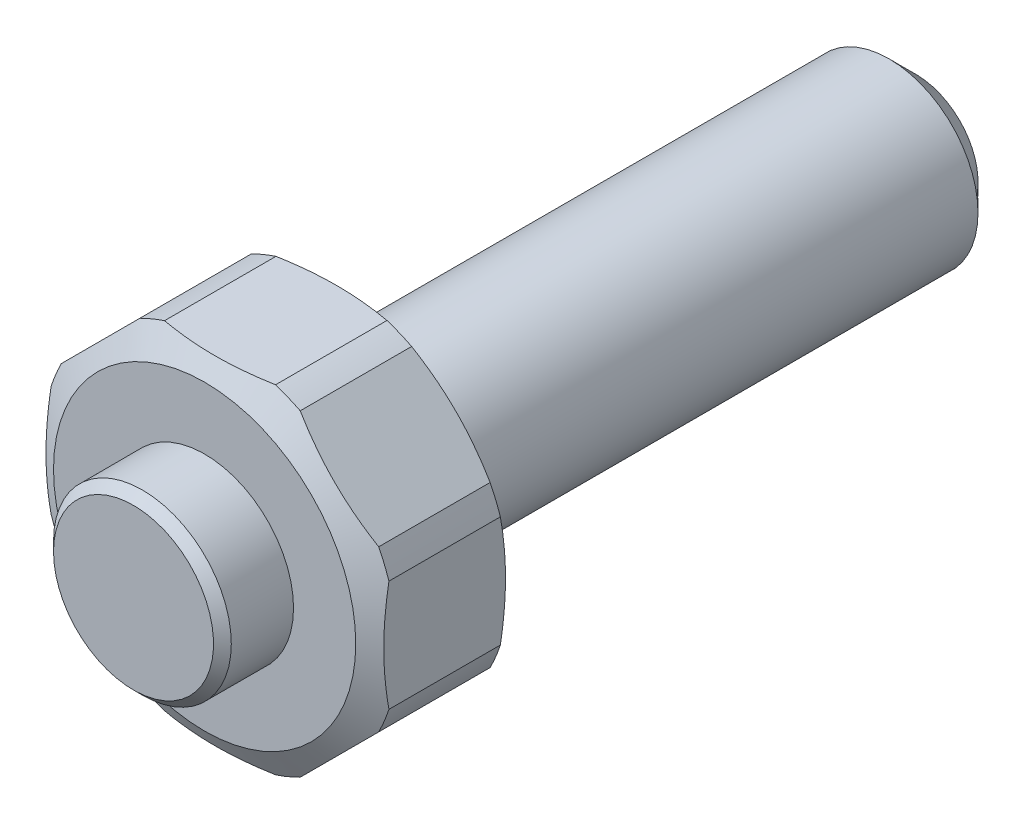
ISO-10303-21;
HEADER;
FILE_DESCRIPTION(('STEP AP214'),'2;1');
FILE_NAME('part.step','',(''),(''),'','','');
FILE_SCHEMA(('AUTOMOTIVE_DESIGN { 1 0 10303 214 1 1 1 1 }'));
ENDSEC;
DATA;
#1=APPLICATION_CONTEXT('core data for automotive mechanical design processes');
#2=APPLICATION_PROTOCOL_DEFINITION('international standard','automotive_design',2000,#1);
#3=PRODUCT_CONTEXT('',#1,'mechanical');
#4=PRODUCT('Part','Part','',(#3));
#5=PRODUCT_RELATED_PRODUCT_CATEGORY('part','',(#4));
#6=PRODUCT_DEFINITION_FORMATION('','',#4);
#7=PRODUCT_DEFINITION_CONTEXT('part definition',#1,'design');
#8=PRODUCT_DEFINITION('design','',#6,#7);
#9=PRODUCT_DEFINITION_SHAPE('','',#8);
#10=(LENGTH_UNIT() NAMED_UNIT(*) SI_UNIT(.MILLI.,.METRE.));
#11=(NAMED_UNIT(*) PLANE_ANGLE_UNIT() SI_UNIT($,.RADIAN.));
#12=(NAMED_UNIT(*) SI_UNIT($,.STERADIAN.) SOLID_ANGLE_UNIT());
#13=UNCERTAINTY_MEASURE_WITH_UNIT(LENGTH_MEASURE(1.E-05),#10,'distance_accuracy_value','');
#14=(GEOMETRIC_REPRESENTATION_CONTEXT(3) GLOBAL_UNCERTAINTY_ASSIGNED_CONTEXT((#13)) GLOBAL_UNIT_ASSIGNED_CONTEXT((#10,
#11,#12)) REPRESENTATION_CONTEXT('',''));
#15=CARTESIAN_POINT('',(0.,0.,0.));
#16=DIRECTION('',(0.,0.,1.));
#17=DIRECTION('',(1.,0.,0.));
#18=AXIS2_PLACEMENT_3D('',#15,#16,#17);
#19=CARTESIAN_POINT('',(0.,0.,33.));
#20=DIRECTION('',(0.,0.,1.));
#21=DIRECTION('',(1.,0.,0.));
#22=AXIS2_PLACEMENT_3D('',#19,#20,#21);
#23=CYLINDRICAL_SURFACE('',#22,5.);
#24=CARTESIAN_POINT('',(0.,0.,-30.5));
#25=DIRECTION('',(0.,0.,-1.));
#26=DIRECTION('',(-1.,0.,0.));
#27=AXIS2_PLACEMENT_3D('',#24,#25,#26);
#28=CIRCLE('',#27,5.);
#29=CARTESIAN_POINT('',(-5.,0.,-30.5));
#30=VERTEX_POINT('',#29);
#31=EDGE_CURVE('E9',#30,#30,#28,.F.);
#32=ORIENTED_EDGE('',*,*,#31,.T.);
#33=EDGE_LOOP('',(#32));
#34=FACE_BOUND('',#33,.T.);
#35=CARTESIAN_POINT('',(0.,0.,0.));
#36=DIRECTION('',(0.,0.,1.));
#37=DIRECTION('',(1.,0.,0.));
#38=AXIS2_PLACEMENT_3D('',#35,#36,#37);
#39=CIRCLE('',#38,5.);
#40=CARTESIAN_POINT('',(5.,0.,0.));
#41=VERTEX_POINT('',#40);
#42=EDGE_CURVE('E349',#41,#41,#39,.T.);
#43=ORIENTED_EDGE('',*,*,#42,.F.);
#44=EDGE_LOOP('',(#43));
#45=FACE_BOUND('',#44,.T.);
#46=ADVANCED_FACE('F14',(#34,#45),#23,.T.);
#47=CARTESIAN_POINT('',(5.,0.,0.));
#48=DIRECTION('',(0.,0.,1.));
#49=DIRECTION('',(1.,0.,0.));
#50=AXIS2_PLACEMENT_3D('',#47,#48,#49);
#51=PLANE('',#50);
#52=ORIENTED_EDGE('',*,*,#42,.T.);
#53=EDGE_LOOP('',(#52));
#54=FACE_BOUND('',#53,.T.);
#55=CARTESIAN_POINT('',(0.,0.,0.));
#56=DIRECTION('',(0.,0.,-1.));
#57=DIRECTION('',(-1.,0.,0.));
#58=AXIS2_PLACEMENT_3D('',#55,#56,#57);
#59=CIRCLE('',#58,8.5);
#60=CARTESIAN_POINT('',(-8.5,0.,0.));
#61=VERTEX_POINT('',#60);
#62=EDGE_CURVE('E424',#61,#61,#59,.T.);
#63=ORIENTED_EDGE('',*,*,#62,.T.);
#64=EDGE_LOOP('',(#63));
#65=FACE_BOUND('',#64,.T.);
#66=ADVANCED_FACE('F319',(#54,#65),#51,.F.);
#67=CARTESIAN_POINT('',(0.,0.,-47.));
#68=DIRECTION('',(0.,0.,-1.));
#69=DIRECTION('',(-1.,0.,0.));
#70=AXIS2_PLACEMENT_3D('',#67,#68,#69);
#71=CYLINDRICAL_SURFACE('',#70,10.);
#72=CARTESIAN_POINT('',(0.,0.,7.1339745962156));
#73=DIRECTION('',(0.,0.,-1.));
#74=DIRECTION('',(-1.,0.,0.));
#75=AXIS2_PLACEMENT_3D('',#72,#73,#74);
#76=CIRCLE('',#75,10.);
#77=CARTESIAN_POINT('',(4.50957420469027,-8.92545463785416,7.1339745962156));
#78=VERTEX_POINT('',#77);
#79=CARTESIAN_POINT('',(3.12249899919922,-9.5,7.1339745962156));
#80=VERTEX_POINT('',#79);
#81=EDGE_CURVE('E432',#78,#80,#76,.T.);
#82=ORIENTED_EDGE('',*,*,#81,.T.);
#83=DIRECTION('',(0.,0.,-1.));
#84=VECTOR('',#83,1.);
#85=CARTESIAN_POINT('',(3.12249899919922,-9.5,-47.));
#86=LINE('',#85,#84);
#87=CARTESIAN_POINT('',(3.12249899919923,-9.5,0.866025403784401));
#88=VERTEX_POINT('',#87);
#89=EDGE_CURVE('E402',#80,#88,#86,.T.);
#90=ORIENTED_EDGE('',*,*,#89,.T.);
#91=CARTESIAN_POINT('',(0.,0.,0.866025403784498));
#92=DIRECTION('',(0.,0.,1.));
#93=DIRECTION('',(1.,0.,0.));
#94=AXIS2_PLACEMENT_3D('',#91,#92,#93);
#95=CIRCLE('',#94,10.);
#96=CARTESIAN_POINT('',(4.50957420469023,-8.92545463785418,0.866025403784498));
#97=VERTEX_POINT('',#96);
#98=EDGE_CURVE('E395',#97,#88,#95,.F.);
#99=ORIENTED_EDGE('',*,*,#98,.F.);
#100=DIRECTION('',(0.,0.,-1.));
#101=VECTOR('',#100,1.);
#102=CARTESIAN_POINT('',(4.50957420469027,-8.92545463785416,-47.));
#103=LINE('',#102,#101);
#104=EDGE_CURVE('E357',#78,#97,#103,.T.);
#105=ORIENTED_EDGE('',*,*,#104,.F.);
#106=EDGE_LOOP('',(#82,#90,#99,#105));
#107=FACE_BOUND('',#106,.T.);
#108=ADVANCED_FACE('F188',(#107),#71,.T.);
#109=CARTESIAN_POINT('',(9.5,-3.12249899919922,0.866025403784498));
#110=VERTEX_POINT('',#109);
#111=CARTESIAN_POINT('',(8.92545463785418,-4.50957420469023,0.866025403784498));
#112=VERTEX_POINT('',#111);
#113=EDGE_CURVE('E29',#110,#112,#95,.F.);
#114=ORIENTED_EDGE('',*,*,#113,.F.);
#115=DIRECTION('',(0.,0.,-1.));
#116=VECTOR('',#115,1.);
#117=CARTESIAN_POINT('',(9.5,-3.12249899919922,-47.));
#118=LINE('',#117,#116);
#119=CARTESIAN_POINT('',(9.5,-3.12249899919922,7.1339745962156));
#120=VERTEX_POINT('',#119);
#121=EDGE_CURVE('E363',#120,#110,#118,.T.);
#122=ORIENTED_EDGE('',*,*,#121,.F.);
#123=CARTESIAN_POINT('',(8.92545463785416,-4.50957420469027,7.1339745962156));
#124=VERTEX_POINT('',#123);
#125=EDGE_CURVE('E435',#120,#124,#76,.T.);
#126=ORIENTED_EDGE('',*,*,#125,.T.);
#127=DIRECTION('',(0.,0.,-1.));
#128=VECTOR('',#127,1.);
#129=CARTESIAN_POINT('',(8.92545463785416,-4.50957420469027,-47.));
#130=LINE('',#129,#128);
#131=EDGE_CURVE('E360',#112,#124,#130,.F.);
#132=ORIENTED_EDGE('',*,*,#131,.F.);
#133=EDGE_LOOP('',(#114,#122,#126,#132));
#134=FACE_BOUND('',#133,.T.);
#135=ADVANCED_FACE('F548',(#134),#71,.T.);
#136=CARTESIAN_POINT('',(8.92545463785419,4.50957420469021,0.866025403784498));
#137=VERTEX_POINT('',#136);
#138=CARTESIAN_POINT('',(9.5,3.12249899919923,0.866025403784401));
#139=VERTEX_POINT('',#138);
#140=EDGE_CURVE('E35',#137,#139,#95,.F.);
#141=ORIENTED_EDGE('',*,*,#140,.F.);
#142=DIRECTION('',(0.,0.,-1.));
#143=VECTOR('',#142,1.);
#144=CARTESIAN_POINT('',(8.92545463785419,4.50957420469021,-47.));
#145=LINE('',#144,#143);
#146=CARTESIAN_POINT('',(8.92545463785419,4.50957420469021,7.1339745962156));
#147=VERTEX_POINT('',#146);
#148=EDGE_CURVE('E369',#147,#137,#145,.T.);
#149=ORIENTED_EDGE('',*,*,#148,.F.);
#150=CARTESIAN_POINT('',(9.5,3.12249899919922,7.1339745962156));
#151=VERTEX_POINT('',#150);
#152=EDGE_CURVE('E436',#147,#151,#76,.T.);
#153=ORIENTED_EDGE('',*,*,#152,.T.);
#154=DIRECTION('',(0.,0.,-1.));
#155=VECTOR('',#154,1.);
#156=CARTESIAN_POINT('',(9.5,3.12249899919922,-47.));
#157=LINE('',#156,#155);
#158=EDGE_CURVE('E366',#139,#151,#157,.F.);
#159=ORIENTED_EDGE('',*,*,#158,.F.);
#160=EDGE_LOOP('',(#141,#149,#153,#159));
#161=FACE_BOUND('',#160,.T.);
#162=ADVANCED_FACE('F554',(#161),#71,.T.);
#163=CARTESIAN_POINT('',(3.12249899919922,9.5,0.866025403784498));
#164=VERTEX_POINT('',#163);
#165=CARTESIAN_POINT('',(4.50957420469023,8.92545463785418,0.866025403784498));
#166=VERTEX_POINT('',#165);
#167=EDGE_CURVE('E420',#164,#166,#95,.F.);
#168=ORIENTED_EDGE('',*,*,#167,.F.);
#169=DIRECTION('',(0.,0.,-1.));
#170=VECTOR('',#169,1.);
#171=CARTESIAN_POINT('',(3.12249899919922,9.5,-47.));
#172=LINE('',#171,#170);
#173=CARTESIAN_POINT('',(3.12249899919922,9.5,7.1339745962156));
#174=VERTEX_POINT('',#173);
#175=EDGE_CURVE('E375',#174,#164,#172,.T.);
#176=ORIENTED_EDGE('',*,*,#175,.F.);
#177=CARTESIAN_POINT('',(4.50957420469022,8.92545463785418,7.1339745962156));
#178=VERTEX_POINT('',#177);
#179=EDGE_CURVE('E635',#174,#178,#76,.T.);
#180=ORIENTED_EDGE('',*,*,#179,.T.);
#181=DIRECTION('',(0.,0.,-1.));
#182=VECTOR('',#181,1.);
#183=CARTESIAN_POINT('',(4.50957420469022,8.92545463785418,-47.));
#184=LINE('',#183,#182);
#185=EDGE_CURVE('E372',#166,#178,#184,.F.);
#186=ORIENTED_EDGE('',*,*,#185,.F.);
#187=EDGE_LOOP('',(#168,#176,#180,#186));
#188=FACE_BOUND('',#187,.T.);
#189=ADVANCED_FACE('F562',(#188),#71,.T.);
#190=CARTESIAN_POINT('',(-4.5095742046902,8.92545463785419,0.866025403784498));
#191=VERTEX_POINT('',#190);
#192=CARTESIAN_POINT('',(-3.12249899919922,9.5,0.866025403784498));
#193=VERTEX_POINT('',#192);
#194=EDGE_CURVE('E414',#191,#193,#95,.F.);
#195=ORIENTED_EDGE('',*,*,#194,.F.);
#196=DIRECTION('',(0.,0.,-1.));
#197=VECTOR('',#196,1.);
#198=CARTESIAN_POINT('',(-4.5095742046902,8.92545463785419,-47.));
#199=LINE('',#198,#197);
#200=CARTESIAN_POINT('',(-4.5095742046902,8.92545463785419,7.1339745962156));
#201=VERTEX_POINT('',#200);
#202=EDGE_CURVE('E381',#201,#191,#199,.T.);
#203=ORIENTED_EDGE('',*,*,#202,.F.);
#204=CARTESIAN_POINT('',(-3.12249899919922,9.5,7.1339745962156));
#205=VERTEX_POINT('',#204);
#206=EDGE_CURVE('E150',#201,#205,#76,.T.);
#207=ORIENTED_EDGE('',*,*,#206,.T.);
#208=DIRECTION('',(0.,0.,-1.));
#209=VECTOR('',#208,1.);
#210=CARTESIAN_POINT('',(-3.12249899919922,9.5,-47.));
#211=LINE('',#210,#209);
#212=EDGE_CURVE('E378',#193,#205,#211,.F.);
#213=ORIENTED_EDGE('',*,*,#212,.F.);
#214=EDGE_LOOP('',(#195,#203,#207,#213));
#215=FACE_BOUND('',#214,.T.);
#216=ADVANCED_FACE('F417',(#215),#71,.T.);
#217=DIRECTION('',(0.,0.,-1.));
#218=VECTOR('',#217,1.);
#219=CARTESIAN_POINT('',(-9.5,-3.12249899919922,-47.));
#220=LINE('',#219,#218);
#221=CARTESIAN_POINT('',(-9.5,-3.12249899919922,7.1339745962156));
#222=VERTEX_POINT('',#221);
#223=CARTESIAN_POINT('',(-9.5,-3.12249899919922,0.866025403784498));
#224=VERTEX_POINT('',#223);
#225=EDGE_CURVE('E137',#222,#224,#220,.T.);
#226=ORIENTED_EDGE('',*,*,#225,.T.);
#227=CARTESIAN_POINT('',(-8.92545463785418,-4.50957420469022,0.866025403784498));
#228=VERTEX_POINT('',#227);
#229=EDGE_CURVE('E421',#228,#224,#95,.F.);
#230=ORIENTED_EDGE('',*,*,#229,.F.);
#231=DIRECTION('',(0.,0.,-1.));
#232=VECTOR('',#231,1.);
#233=CARTESIAN_POINT('',(-8.92545463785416,-4.50957420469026,-47.));
#234=LINE('',#233,#232);
#235=CARTESIAN_POINT('',(-8.92545463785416,-4.50957420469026,7.1339745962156));
#236=VERTEX_POINT('',#235);
#237=EDGE_CURVE('E388',#228,#236,#234,.F.);
#238=ORIENTED_EDGE('',*,*,#237,.T.);
#239=EDGE_CURVE('E152',#236,#222,#76,.T.);
#240=ORIENTED_EDGE('',*,*,#239,.T.);
#241=EDGE_LOOP('',(#226,#230,#238,#240));
#242=FACE_BOUND('',#241,.T.);
#243=ADVANCED_FACE('F438',(#242),#71,.T.);
#244=CARTESIAN_POINT('',(-9.5,3.12249899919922,0.866025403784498));
#245=VERTEX_POINT('',#244);
#246=CARTESIAN_POINT('',(-8.92545463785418,4.50957420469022,0.866025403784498));
#247=VERTEX_POINT('',#246);
#248=EDGE_CURVE('E133',#245,#247,#95,.F.);
#249=ORIENTED_EDGE('',*,*,#248,.F.);
#250=DIRECTION('',(0.,0.,-1.));
#251=VECTOR('',#250,1.);
#252=CARTESIAN_POINT('',(-9.5,3.12249899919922,-47.));
#253=LINE('',#252,#251);
#254=CARTESIAN_POINT('',(-9.5,3.12249899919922,7.1339745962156));
#255=VERTEX_POINT('',#254);
#256=EDGE_CURVE('E127',#245,#255,#253,.F.);
#257=ORIENTED_EDGE('',*,*,#256,.T.);
#258=CARTESIAN_POINT('',(-8.92545463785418,4.50957420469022,7.1339745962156));
#259=VERTEX_POINT('',#258);
#260=EDGE_CURVE('E131',#255,#259,#76,.T.);
#261=ORIENTED_EDGE('',*,*,#260,.T.);
#262=DIRECTION('',(0.,0.,-1.));
#263=VECTOR('',#262,1.);
#264=CARTESIAN_POINT('',(-8.92545463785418,4.50957420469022,-47.));
#265=LINE('',#264,#263);
#266=EDGE_CURVE('E384',#247,#259,#265,.F.);
#267=ORIENTED_EDGE('',*,*,#266,.F.);
#268=EDGE_LOOP('',(#249,#257,#261,#267));
#269=FACE_BOUND('',#268,.T.);
#270=ADVANCED_FACE('F129',(#269),#71,.T.);
#271=DIRECTION('',(0.,0.,-1.));
#272=VECTOR('',#271,1.);
#273=CARTESIAN_POINT('',(-4.50957420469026,-8.92545463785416,-47.));
#274=LINE('',#273,#272);
#275=CARTESIAN_POINT('',(-4.50957420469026,-8.92545463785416,7.1339745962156));
#276=VERTEX_POINT('',#275);
#277=CARTESIAN_POINT('',(-4.50957420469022,-8.92545463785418,0.866025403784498));
#278=VERTEX_POINT('',#277);
#279=EDGE_CURVE('E138',#276,#278,#274,.T.);
#280=ORIENTED_EDGE('',*,*,#279,.T.);
#281=CARTESIAN_POINT('',(-3.12249899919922,-9.5,0.866025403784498));
#282=VERTEX_POINT('',#281);
#283=EDGE_CURVE('E404',#282,#278,#95,.F.);
#284=ORIENTED_EDGE('',*,*,#283,.F.);
#285=DIRECTION('',(0.,0.,-1.));
#286=VECTOR('',#285,1.);
#287=CARTESIAN_POINT('',(-3.12249899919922,-9.5,-47.));
#288=LINE('',#287,#286);
#289=CARTESIAN_POINT('',(-3.12249899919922,-9.5,7.1339745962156));
#290=VERTEX_POINT('',#289);
#291=EDGE_CURVE('E430',#282,#290,#288,.F.);
#292=ORIENTED_EDGE('',*,*,#291,.T.);
#293=EDGE_CURVE('E434',#290,#276,#76,.T.);
#294=ORIENTED_EDGE('',*,*,#293,.T.);
#295=EDGE_LOOP('',(#280,#284,#292,#294));
#296=FACE_BOUND('',#295,.T.);
#297=ADVANCED_FACE('F263',(#296),#71,.T.);
#298=CARTESIAN_POINT('',(0.,0.,1.2519735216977));
#299=DIRECTION('',(0.,0.,1.));
#300=DIRECTION('',(1.,0.,0.));
#301=AXIS2_PLACEMENT_3D('',#298,#299,#300);
#302=CONICAL_SURFACE('',#301,10.6684817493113,1.0471975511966);
#303=CARTESIAN_POINT('',(8.92623897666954,-4.50878986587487,0.866225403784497));
#304=CARTESIAN_POINT('',(8.76725039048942,-4.66777845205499,0.825659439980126));
#305=CARTESIAN_POINT('',(8.60775417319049,-4.82727466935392,0.788950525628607));
#306=CARTESIAN_POINT('',(8.28788818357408,-5.14714065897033,0.723814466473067));
#307=CARTESIAN_POINT('',(8.12751824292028,-5.30751059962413,0.695388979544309));
#308=CARTESIAN_POINT('',(7.80607824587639,-5.62895059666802,0.647399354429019));
#309=CARTESIAN_POINT('',(7.64500805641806,-5.79002078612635,0.627836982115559));
#310=CARTESIAN_POINT('',(7.32244893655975,-6.11257990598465,0.597991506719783));
#311=CARTESIAN_POINT('',(7.16096004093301,-6.2740688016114,0.587707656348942));
#312=CARTESIAN_POINT('',(6.84003571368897,-6.59499312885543,0.576721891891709));
#313=CARTESIAN_POINT('',(6.68060250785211,-6.75442633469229,0.575890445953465));
#314=CARTESIAN_POINT('',(6.36184642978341,-7.073182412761,0.583492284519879));
#315=CARTESIAN_POINT('',(6.20252355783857,-7.23250528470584,0.591925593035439));
#316=CARTESIAN_POINT('',(5.88433570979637,-7.55069313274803,0.617866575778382));
#317=CARTESIAN_POINT('',(5.72547053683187,-7.70955830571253,0.63536947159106));
#318=CARTESIAN_POINT('',(5.40835671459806,-8.02667212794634,0.679082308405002));
#319=CARTESIAN_POINT('',(5.25010799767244,-8.18492084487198,0.705291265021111));
#320=CARTESIAN_POINT('',(5.0435304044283,-8.39149843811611,0.744954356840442));
#321=CARTESIAN_POINT('',(4.99483434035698,-8.44019450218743,0.754702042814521));
#322=CARTESIAN_POINT('',(4.89752615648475,-8.53750268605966,0.774960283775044));
#323=CARTESIAN_POINT('',(4.84891402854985,-8.58611481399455,0.785470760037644));
#324=CARTESIAN_POINT('',(4.75166725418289,-8.68336158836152,0.807261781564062));
#325=CARTESIAN_POINT('',(4.70303279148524,-8.73199605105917,0.81854396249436));
#326=CARTESIAN_POINT('',(4.60584700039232,-8.82918184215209,0.841840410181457));
#327=CARTESIAN_POINT('',(4.55729568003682,-8.87773316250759,0.853854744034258));
#328=CARTESIAN_POINT('',(4.50878986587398,-8.92623897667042,0.866225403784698));
#329=B_SPLINE_CURVE_WITH_KNOTS('',3,(#303,#304,#305,#306,#307,#308,#309,#310,#311,#312,#313,
#314,#315,#316,#317,#318,#319,#320,#321,#322,#323,#324,#325,#326,#327,#328),.UNSPECIFIED.,.F.,
.F.,(4,2,2,2,2,2,2,2,2,2,2,2,4),(0.,0.685420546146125,1.37097818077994,2.05667234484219,
2.74231127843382,3.41854298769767,4.09477644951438,4.77065399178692,5.44645513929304,
5.65511208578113,5.86374752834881,6.07283977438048,6.28195121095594),.UNSPECIFIED.);
#330=EDGE_CURVE('E248',#112,#97,#329,.T.);
#331=ORIENTED_EDGE('',*,*,#330,.T.);
#332=ORIENTED_EDGE('',*,*,#98,.T.);
#333=CARTESIAN_POINT('',(-11.7991337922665,-9.5,3.8383704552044));
#334=CARTESIAN_POINT('',(-11.6196197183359,-9.5,3.75764424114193));
#335=CARTESIAN_POINT('',(-11.4398364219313,-9.5,3.67751717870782));
#336=CARTESIAN_POINT('',(-11.0796807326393,-9.5,3.5185898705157));
#337=CARTESIAN_POINT('',(-10.8993083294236,-9.5,3.43978964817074));
#338=CARTESIAN_POINT('',(-10.3571587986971,-9.5,3.20554074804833));
#339=CARTESIAN_POINT('',(-9.99443096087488,-9.5,3.05228067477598));
#340=CARTESIAN_POINT('',(-9.26387410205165,-9.5,2.75200834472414));
#341=CARTESIAN_POINT('',(-8.89602758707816,-9.5,2.60503851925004));
#342=CARTESIAN_POINT('',(-8.15690987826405,-9.5,2.32000550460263));
#343=CARTESIAN_POINT('',(-7.78563890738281,-9.5,2.18194174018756));
#344=CARTESIAN_POINT('',(-7.04316993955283,-9.5,1.9182460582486));
#345=CARTESIAN_POINT('',(-6.67201393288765,-9.5,1.79249660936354));
#346=CARTESIAN_POINT('',(-5.9253925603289,-9.5,1.55429452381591));
#347=CARTESIAN_POINT('',(-5.54992687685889,-9.5,1.44184287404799));
#348=CARTESIAN_POINT('',(-4.79528025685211,-9.5,1.23350959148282));
#349=CARTESIAN_POINT('',(-4.41610937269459,-9.5,1.13759186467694));
#350=CARTESIAN_POINT('',(-3.65333357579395,-9.5,0.965449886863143));
#351=CARTESIAN_POINT('',(-3.26972975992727,-9.5,0.889220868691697));
#352=CARTESIAN_POINT('',(-2.66208882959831,-9.5,0.787300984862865));
#353=CARTESIAN_POINT('',(-2.43933466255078,-9.5,0.75388408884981));
#354=CARTESIAN_POINT('',(-1.99274850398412,-9.5,0.695313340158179));
#355=CARTESIAN_POINT('',(-1.76891659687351,-9.5,0.670158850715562));
#356=CARTESIAN_POINT('',(-1.32040221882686,-9.5,0.628600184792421));
#357=CARTESIAN_POINT('',(-1.09571961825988,-9.5,0.612197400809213));
#358=CARTESIAN_POINT('',(-0.645869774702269,-9.5,0.588490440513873));
#359=CARTESIAN_POINT('',(-0.42070252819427,-9.5,0.58118633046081));
#360=CARTESIAN_POINT('',(0.0299682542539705,-9.5,0.575833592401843));
#361=CARTESIAN_POINT('',(0.255471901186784,-9.5,0.577794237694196));
#362=CARTESIAN_POINT('',(0.706205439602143,-9.5,0.590948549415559));
#363=CARTESIAN_POINT('',(0.931435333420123,-9.5,0.602142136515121));
#364=CARTESIAN_POINT('',(1.38119404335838,-9.5,0.633517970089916));
#365=CARTESIAN_POINT('',(1.60572305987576,-9.5,0.65369735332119));
#366=CARTESIAN_POINT('',(2.05385286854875,-9.5,0.702628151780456));
#367=CARTESIAN_POINT('',(2.27745357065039,-9.5,0.731380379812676));
#368=CARTESIAN_POINT('',(2.97093135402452,-9.5,0.83330448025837));
#369=CARTESIAN_POINT('',(3.43880776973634,-9.5,0.920366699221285));
#370=CARTESIAN_POINT('',(4.36807181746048,-9.5,1.12423701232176));
#371=CARTESIAN_POINT('',(4.82945621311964,-9.5,1.24105942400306));
#372=CARTESIAN_POINT('',(5.74730092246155,-9.5,1.49876979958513));
#373=CARTESIAN_POINT('',(6.20373520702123,-9.5,1.63974931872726));
#374=CARTESIAN_POINT('',(7.11035554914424,-9.5,1.94013357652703));
#375=CARTESIAN_POINT('',(7.56054247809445,-9.5,2.09953571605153));
#376=CARTESIAN_POINT('',(8.46087603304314,-9.5,2.43456119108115));
#377=CARTESIAN_POINT('',(8.91095899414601,-9.5,2.61035433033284));
#378=CARTESIAN_POINT('',(9.80656288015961,-9.5,2.97323675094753));
#379=CARTESIAN_POINT('',(10.2520834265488,-9.5,3.16032696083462));
#380=CARTESIAN_POINT('',(11.1349942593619,-9.5,3.54144819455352));
#381=CARTESIAN_POINT('',(11.5724214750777,-9.5,3.73539398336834));
#382=CARTESIAN_POINT('',(12.2261672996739,-9.5,4.03140711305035));
#383=CARTESIAN_POINT('',(12.4436522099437,-9.5,4.1309125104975));
#384=CARTESIAN_POINT('',(12.8779098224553,-9.5,4.33145496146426));
#385=CARTESIAN_POINT('',(13.0946825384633,-9.5,4.43249198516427));
#386=CARTESIAN_POINT('',(13.3111357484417,-9.5,4.5342092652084));
#387=B_SPLINE_CURVE_WITH_KNOTS('',3,(#333,#334,#335,#336,#337,#338,#339,#340,#341,#342,#343,
#344,#345,#346,#347,#348,#349,#350,#351,#352,#353,#354,#355,#356,#357,#358,#359,#360,#361,#362,
#363,#364,#365,#366,#367,#368,#369,#370,#371,#372,#373,#374,#375,#376,#377,#378,#379,#380,#381,
#382,#383,#384,#385,#386),.UNSPECIFIED.,.F.,.F.,(4,2,2,2,2,2,2,2,2,2,2,2,2,2,2,2,2,2,2,2,2,2,2,
2,2,2,4),(0.,0.590487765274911,1.1809859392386,2.3622508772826,3.5505196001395,4.73871149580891,
5.91414991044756,7.08967550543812,8.26260147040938,9.43524317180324,10.1108513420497,
10.7864074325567,11.4620709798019,12.1377394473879,12.8140843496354,13.4904234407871,
14.1665471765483,14.8427350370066,16.2691371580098,17.6962268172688,19.1288498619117,
20.5612710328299,22.0106625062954,23.4601732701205,24.8955818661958,25.6130792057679,
26.3305625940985),.UNSPECIFIED.);
#388=EDGE_CURVE('E268',#282,#88,#387,.T.);
#389=ORIENTED_EDGE('',*,*,#388,.F.);
#390=ORIENTED_EDGE('',*,*,#283,.T.);
#391=CARTESIAN_POINT('',(-8.92623897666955,-4.50878986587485,0.866225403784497));
#392=CARTESIAN_POINT('',(-8.76725039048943,-4.66777845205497,0.825659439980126));
#393=CARTESIAN_POINT('',(-8.60775417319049,-4.8272746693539,0.788950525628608));
#394=CARTESIAN_POINT('',(-8.28788818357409,-5.14714065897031,0.723814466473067));
#395=CARTESIAN_POINT('',(-8.12751824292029,-5.30751059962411,0.695388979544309));
#396=CARTESIAN_POINT('',(-7.8060782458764,-5.628950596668,0.647399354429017));
#397=CARTESIAN_POINT('',(-7.64500805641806,-5.79002078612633,0.627836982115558));
#398=CARTESIAN_POINT('',(-7.32244893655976,-6.11257990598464,0.597991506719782));
#399=CARTESIAN_POINT('',(-7.16096004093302,-6.27406880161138,0.58770765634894));
#400=CARTESIAN_POINT('',(-6.84003571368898,-6.59499312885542,0.576721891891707));
#401=CARTESIAN_POINT('',(-6.68060250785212,-6.75442633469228,0.575890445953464));
#402=CARTESIAN_POINT('',(-6.36184642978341,-7.07318241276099,0.583492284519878));
#403=CARTESIAN_POINT('',(-6.20252355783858,-7.23250528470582,0.591925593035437));
#404=CARTESIAN_POINT('',(-5.88433570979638,-7.55069313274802,0.617866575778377));
#405=CARTESIAN_POINT('',(-5.72547053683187,-7.70955830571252,0.635369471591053));
#406=CARTESIAN_POINT('',(-5.40835671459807,-8.02667212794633,0.679082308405));
#407=CARTESIAN_POINT('',(-5.25010799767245,-8.18492084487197,0.705291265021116));
#408=CARTESIAN_POINT('',(-5.04353040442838,-8.39149843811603,0.744954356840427));
#409=CARTESIAN_POINT('',(-4.99483434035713,-8.44019450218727,0.754702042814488));
#410=CARTESIAN_POINT('',(-4.89752615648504,-8.53750268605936,0.774960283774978));
#411=CARTESIAN_POINT('',(-4.84891402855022,-8.58611481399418,0.785470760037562));
#412=CARTESIAN_POINT('',(-4.75166725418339,-8.68336158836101,0.807261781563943));
#413=CARTESIAN_POINT('',(-4.70303279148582,-8.73199605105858,0.81854396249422));
#414=CARTESIAN_POINT('',(-4.60584700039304,-8.82918184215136,0.841840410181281));
#415=CARTESIAN_POINT('',(-4.55729568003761,-8.87773316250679,0.853854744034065));
#416=CARTESIAN_POINT('',(-4.50878986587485,-8.92623897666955,0.866225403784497));
#417=B_SPLINE_CURVE_WITH_KNOTS('',3,(#391,#392,#393,#394,#395,#396,#397,#398,#399,#400,#401,
#402,#403,#404,#405,#406,#407,#408,#409,#410,#411,#412,#413,#414,#415,#416),.UNSPECIFIED.,.F.,
.F.,(4,2,2,2,2,2,2,2,2,2,2,2,4),(0.,0.685420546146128,1.37097818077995,2.0566723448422,
2.74231127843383,3.41854298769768,4.09477644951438,4.77065399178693,5.44645513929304,
5.65511208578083,5.86374752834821,6.07283977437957,6.28195121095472),.UNSPECIFIED.);
#418=EDGE_CURVE('E277',#228,#278,#417,.T.);
#419=ORIENTED_EDGE('',*,*,#418,.F.);
#420=ORIENTED_EDGE('',*,*,#229,.T.);
#421=CARTESIAN_POINT('',(-9.5,-11.7991337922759,3.8383704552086));
#422=CARTESIAN_POINT('',(-9.5,-11.6196197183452,3.75764424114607));
#423=CARTESIAN_POINT('',(-9.50000000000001,-11.4398364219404,3.67751717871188));
#424=CARTESIAN_POINT('',(-9.50000000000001,-11.0796807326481,3.51858987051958));
#425=CARTESIAN_POINT('',(-9.50000000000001,-10.8993083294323,3.43978964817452));
#426=CARTESIAN_POINT('',(-9.50000000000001,-10.3571587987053,3.20554074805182));
#427=CARTESIAN_POINT('',(-9.50000000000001,-9.99443096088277,3.05228067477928));
#428=CARTESIAN_POINT('',(-9.50000000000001,-9.26387410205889,2.75200834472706));
#429=CARTESIAN_POINT('',(-9.50000000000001,-8.89602758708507,2.60503851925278));
#430=CARTESIAN_POINT('',(-9.50000000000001,-8.15690987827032,2.32000550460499));
#431=CARTESIAN_POINT('',(-9.50000000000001,-7.78563890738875,2.18194174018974));
#432=CARTESIAN_POINT('',(-9.50000000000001,-7.04316993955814,1.91824605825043));
#433=CARTESIAN_POINT('',(-9.50000000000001,-6.67201393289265,1.7924966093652));
#434=CARTESIAN_POINT('',(-9.50000000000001,-5.92539256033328,1.55429452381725));
#435=CARTESIAN_POINT('',(-9.5,-5.54992687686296,1.44184287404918));
#436=CARTESIAN_POINT('',(-9.5,-4.79528025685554,1.23350959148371));
#437=CARTESIAN_POINT('',(-9.50000000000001,-4.41610937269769,1.1375918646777));
#438=CARTESIAN_POINT('',(-9.5,-3.65333357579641,0.965449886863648));
#439=CARTESIAN_POINT('',(-9.5,-3.2697297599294,0.889220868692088));
#440=CARTESIAN_POINT('',(-9.5,-2.66208882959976,0.787300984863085));
#441=CARTESIAN_POINT('',(-9.5,-2.43933466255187,0.753884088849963));
#442=CARTESIAN_POINT('',(-9.5,-1.99274850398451,0.695313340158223));
#443=CARTESIAN_POINT('',(-9.5,-1.76891659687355,0.670158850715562));
#444=CARTESIAN_POINT('',(-9.5,-1.32040221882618,0.628600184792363));
#445=CARTESIAN_POINT('',(-9.5,-1.09571961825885,0.61219740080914));
#446=CARTESIAN_POINT('',(-9.5,-0.64586977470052,0.588490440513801));
#447=CARTESIAN_POINT('',(-9.5,-0.420702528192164,0.581186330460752));
#448=CARTESIAN_POINT('',(-9.5,0.0299682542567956,0.575833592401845));
#449=CARTESIAN_POINT('',(-9.5,0.255471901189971,0.577794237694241));
#450=CARTESIAN_POINT('',(-9.5,0.706205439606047,0.590948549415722));
#451=CARTESIAN_POINT('',(-9.5,0.931435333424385,0.602142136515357));
#452=CARTESIAN_POINT('',(-9.5,1.38119404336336,0.633517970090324));
#453=CARTESIAN_POINT('',(-9.5,1.60572305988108,0.653697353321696));
#454=CARTESIAN_POINT('',(-9.5,2.05385286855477,0.702628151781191));
#455=CARTESIAN_POINT('',(-9.5,2.27745357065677,0.73138037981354));
#456=CARTESIAN_POINT('',(-9.5,2.97093135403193,0.83330448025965));
#457=CARTESIAN_POINT('',(-9.5,3.43880776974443,0.920366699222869));
#458=CARTESIAN_POINT('',(-9.5,4.3680718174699,1.12423701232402));
#459=CARTESIAN_POINT('',(-9.5,4.82945621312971,1.24105942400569));
#460=CARTESIAN_POINT('',(-9.5,5.74730092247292,1.49876979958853));
#461=CARTESIAN_POINT('',(-9.5,6.20373520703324,1.63974931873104));
#462=CARTESIAN_POINT('',(-9.5,7.11035554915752,1.94013357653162));
#463=CARTESIAN_POINT('',(-9.5,7.56054247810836,2.09953571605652));
#464=CARTESIAN_POINT('',(-9.5,8.46087603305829,2.43456119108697));
#465=CARTESIAN_POINT('',(-9.5,8.91095899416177,2.61035433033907));
#466=CARTESIAN_POINT('',(-9.5,9.8065628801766,2.97323675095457));
#467=CARTESIAN_POINT('',(-9.5,10.2520834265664,3.16032696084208));
#468=CARTESIAN_POINT('',(-9.5,11.1349942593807,3.54144819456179));
#469=CARTESIAN_POINT('',(-9.5,11.5724214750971,3.735393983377));
#470=CARTESIAN_POINT('',(-9.5,12.2261672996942,4.03140711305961));
#471=CARTESIAN_POINT('',(-9.5,12.4436522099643,4.13091251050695));
#472=CARTESIAN_POINT('',(-9.5,12.8779098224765,4.33145496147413));
#473=CARTESIAN_POINT('',(-9.5,13.0946825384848,4.43249198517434));
#474=CARTESIAN_POINT('',(-9.5,13.3111357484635,4.5342092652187));
#475=B_SPLINE_CURVE_WITH_KNOTS('',3,(#421,#422,#423,#424,#425,#426,#427,#428,#429,#430,#431,
#432,#433,#434,#435,#436,#437,#438,#439,#440,#441,#442,#443,#444,#445,#446,#447,#448,#449,#450,
#451,#452,#453,#454,#455,#456,#457,#458,#459,#460,#461,#462,#463,#464,#465,#466,#467,#468,#469,
#470,#471,#472,#473,#474),.UNSPECIFIED.,.F.,.F.,(4,2,2,2,2,2,2,2,2,2,2,2,2,2,2,2,2,2,2,2,2,2,2,
2,2,2,4),(0.,0.590487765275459,1.1809859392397,2.36225087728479,3.5505196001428,
4.73871149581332,5.91414991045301,7.08967550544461,8.26260147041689,9.43524317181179,
10.1108513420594,10.7864074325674,11.4620709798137,12.1377394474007,12.8140843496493,
13.4904234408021,14.1665471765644,14.8427350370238,16.2691371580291,17.6962268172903,
19.1288498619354,20.5612710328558,22.0106625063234,23.4601732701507,24.8955818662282,
25.6130792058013,26.3305625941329),.UNSPECIFIED.);
#476=EDGE_CURVE('E284',#245,#224,#475,.F.);
#477=ORIENTED_EDGE('',*,*,#476,.F.);
#478=ORIENTED_EDGE('',*,*,#248,.T.);
#479=CARTESIAN_POINT('',(-8.92623897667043,4.50878986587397,0.866225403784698));
#480=CARTESIAN_POINT('',(-8.76725039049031,4.66777845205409,0.825659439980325));
#481=CARTESIAN_POINT('',(-8.60775417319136,4.82727466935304,0.788950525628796));
#482=CARTESIAN_POINT('',(-8.28788818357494,5.14714065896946,0.723814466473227));
#483=CARTESIAN_POINT('',(-8.12751824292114,5.30751059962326,0.695388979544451));
#484=CARTESIAN_POINT('',(-7.80607824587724,5.62895059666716,0.647399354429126));
#485=CARTESIAN_POINT('',(-7.6450080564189,5.79002078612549,0.62783698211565));
#486=CARTESIAN_POINT('',(-7.32244893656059,6.11257990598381,0.597991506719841));
#487=CARTESIAN_POINT('',(-7.16096004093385,6.27406880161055,0.587707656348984));
#488=CARTESIAN_POINT('',(-6.8400357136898,6.5949931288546,0.576721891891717));
#489=CARTESIAN_POINT('',(-6.68060250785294,6.75442633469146,0.575890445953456));
#490=CARTESIAN_POINT('',(-6.36184642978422,7.07318241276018,0.583492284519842));
#491=CARTESIAN_POINT('',(-6.20252355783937,7.23250528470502,0.591925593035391));
#492=CARTESIAN_POINT('',(-5.88433570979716,7.55069313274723,0.61786657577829));
#493=CARTESIAN_POINT('',(-5.72547053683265,7.70955830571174,0.635369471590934));
#494=CARTESIAN_POINT('',(-5.40835671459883,8.02667212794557,0.679082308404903));
#495=CARTESIAN_POINT('',(-5.2501079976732,8.1849208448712,0.705291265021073));
#496=CARTESIAN_POINT('',(-5.04353040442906,8.39149843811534,0.744954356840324));
#497=CARTESIAN_POINT('',(-4.99483434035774,8.44019450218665,0.75470204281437));
#498=CARTESIAN_POINT('',(-4.89752615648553,8.53750268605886,0.774960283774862));
#499=CARTESIAN_POINT('',(-4.84891402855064,8.58611481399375,0.785470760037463));
#500=CARTESIAN_POINT('',(-4.75166725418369,8.6833615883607,0.807261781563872));
#501=CARTESIAN_POINT('',(-4.70303279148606,8.73199605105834,0.818543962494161));
#502=CARTESIAN_POINT('',(-4.60584700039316,8.82918184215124,0.841840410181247));
#503=CARTESIAN_POINT('',(-4.55729568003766,8.87773316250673,0.853854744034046));
#504=CARTESIAN_POINT('',(-4.50878986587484,8.92623897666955,0.866225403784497));
#505=B_SPLINE_CURVE_WITH_KNOTS('',3,(#479,#480,#481,#482,#483,#484,#485,#486,#487,#488,#489,
#490,#491,#492,#493,#494,#495,#496,#497,#498,#499,#500,#501,#502,#503,#504),.UNSPECIFIED.,.F.,
.F.,(4,2,2,2,2,2,2,2,2,2,2,2,4),(0.,0.685420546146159,1.37097818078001,2.05667234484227,
2.74231127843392,3.41854298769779,4.09477644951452,4.7706539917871,5.44645513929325,
5.6551120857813,5.86374752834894,6.07283977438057,6.28195121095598),.UNSPECIFIED.);
#506=EDGE_CURVE('E291',#247,#191,#505,.T.);
#507=ORIENTED_EDGE('',*,*,#506,.T.);
#508=ORIENTED_EDGE('',*,*,#194,.T.);
#509=CARTESIAN_POINT('',(-11.7991337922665,9.5,3.8383704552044));
#510=CARTESIAN_POINT('',(-11.6196197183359,9.5,3.75764424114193));
#511=CARTESIAN_POINT('',(-11.4398364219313,9.5,3.67751717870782));
#512=CARTESIAN_POINT('',(-11.0796807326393,9.5,3.5185898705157));
#513=CARTESIAN_POINT('',(-10.8993083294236,9.5,3.43978964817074));
#514=CARTESIAN_POINT('',(-10.3571587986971,9.5,3.20554074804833));
#515=CARTESIAN_POINT('',(-9.99443096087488,9.5,3.05228067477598));
#516=CARTESIAN_POINT('',(-9.26387410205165,9.5,2.75200834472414));
#517=CARTESIAN_POINT('',(-8.89602758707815,9.5,2.60503851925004));
#518=CARTESIAN_POINT('',(-8.15690987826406,9.5,2.32000550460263));
#519=CARTESIAN_POINT('',(-7.78563890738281,9.5,2.18194174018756));
#520=CARTESIAN_POINT('',(-7.04316993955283,9.5,1.9182460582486));
#521=CARTESIAN_POINT('',(-6.67201393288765,9.5,1.79249660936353));
#522=CARTESIAN_POINT('',(-5.9253925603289,9.5,1.55429452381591));
#523=CARTESIAN_POINT('',(-5.54992687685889,9.5,1.44184287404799));
#524=CARTESIAN_POINT('',(-4.79528025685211,9.5,1.23350959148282));
#525=CARTESIAN_POINT('',(-4.41610937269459,9.5,1.13759186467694));
#526=CARTESIAN_POINT('',(-3.65333357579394,9.5,0.965449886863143));
#527=CARTESIAN_POINT('',(-3.26972975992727,9.5,0.889220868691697));
#528=CARTESIAN_POINT('',(-2.66208882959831,9.5,0.787300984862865));
#529=CARTESIAN_POINT('',(-2.43933466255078,9.5,0.75388408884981));
#530=CARTESIAN_POINT('',(-1.99274850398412,9.5,0.695313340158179));
#531=CARTESIAN_POINT('',(-1.76891659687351,9.5,0.670158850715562));
#532=CARTESIAN_POINT('',(-1.32040221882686,9.5,0.628600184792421));
#533=CARTESIAN_POINT('',(-1.09571961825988,9.5,0.612197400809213));
#534=CARTESIAN_POINT('',(-0.645869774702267,9.5,0.588490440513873));
#535=CARTESIAN_POINT('',(-0.420702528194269,9.5,0.58118633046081));
#536=CARTESIAN_POINT('',(0.0299682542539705,9.5,0.575833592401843));
#537=CARTESIAN_POINT('',(0.255471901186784,9.5,0.577794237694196));
#538=CARTESIAN_POINT('',(0.706205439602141,9.5,0.590948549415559));
#539=CARTESIAN_POINT('',(0.93143533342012,9.5,0.602142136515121));
#540=CARTESIAN_POINT('',(1.38119404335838,9.5,0.633517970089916));
#541=CARTESIAN_POINT('',(1.60572305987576,9.5,0.65369735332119));
#542=CARTESIAN_POINT('',(2.05385286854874,9.5,0.702628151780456));
#543=CARTESIAN_POINT('',(2.27745357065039,9.5,0.731380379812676));
#544=CARTESIAN_POINT('',(2.97093135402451,9.5,0.83330448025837));
#545=CARTESIAN_POINT('',(3.43880776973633,9.5,0.920366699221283));
#546=CARTESIAN_POINT('',(4.36807181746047,9.5,1.12423701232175));
#547=CARTESIAN_POINT('',(4.82945621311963,9.5,1.24105942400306));
#548=CARTESIAN_POINT('',(5.74730092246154,9.5,1.49876979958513));
#549=CARTESIAN_POINT('',(6.20373520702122,9.5,1.63974931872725));
#550=CARTESIAN_POINT('',(7.11035554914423,9.5,1.94013357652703));
#551=CARTESIAN_POINT('',(7.56054247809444,9.5,2.09953571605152));
#552=CARTESIAN_POINT('',(8.46087603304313,9.5,2.43456119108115));
#553=CARTESIAN_POINT('',(8.910958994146,9.5,2.61035433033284));
#554=CARTESIAN_POINT('',(9.80656288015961,9.5,2.97323675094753));
#555=CARTESIAN_POINT('',(10.2520834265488,9.5,3.16032696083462));
#556=CARTESIAN_POINT('',(11.1349942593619,9.5,3.54144819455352));
#557=CARTESIAN_POINT('',(11.5724214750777,9.5,3.73539398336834));
#558=CARTESIAN_POINT('',(12.2261672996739,9.5,4.03140711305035));
#559=CARTESIAN_POINT('',(12.4436522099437,9.5,4.1309125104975));
#560=CARTESIAN_POINT('',(12.8779098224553,9.5,4.33145496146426));
#561=CARTESIAN_POINT('',(13.0946825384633,9.5,4.43249198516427));
#562=CARTESIAN_POINT('',(13.3111357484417,9.5,4.5342092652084));
#563=B_SPLINE_CURVE_WITH_KNOTS('',3,(#509,#510,#511,#512,#513,#514,#515,#516,#517,#518,#519,
#520,#521,#522,#523,#524,#525,#526,#527,#528,#529,#530,#531,#532,#533,#534,#535,#536,#537,#538,
#539,#540,#541,#542,#543,#544,#545,#546,#547,#548,#549,#550,#551,#552,#553,#554,#555,#556,#557,
#558,#559,#560,#561,#562),.UNSPECIFIED.,.F.,.F.,(4,2,2,2,2,2,2,2,2,2,2,2,2,2,2,2,2,2,2,2,2,2,2,
2,2,2,4),(0.,0.590487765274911,1.18098593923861,2.3622508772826,3.5505196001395,
4.73871149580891,5.91414991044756,7.08967550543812,8.26260147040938,9.43524317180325,
10.1108513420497,10.7864074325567,11.4620709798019,12.1377394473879,12.8140843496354,
13.4904234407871,14.1665471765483,14.8427350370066,16.2691371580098,17.6962268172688,
19.1288498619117,20.5612710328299,22.0106625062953,23.4601732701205,24.8955818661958,
25.6130792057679,26.3305625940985),.UNSPECIFIED.);
#564=EDGE_CURVE('E297',#193,#164,#563,.T.);
#565=ORIENTED_EDGE('',*,*,#564,.T.);
#566=ORIENTED_EDGE('',*,*,#167,.T.);
#567=CARTESIAN_POINT('',(4.50878986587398,8.92623897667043,0.866225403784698));
#568=CARTESIAN_POINT('',(4.6677784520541,8.7672503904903,0.825659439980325));
#569=CARTESIAN_POINT('',(4.82727466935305,8.60775417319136,0.788950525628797));
#570=CARTESIAN_POINT('',(5.14714065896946,8.28788818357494,0.723814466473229));
#571=CARTESIAN_POINT('',(5.30751059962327,8.12751824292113,0.695388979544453));
#572=CARTESIAN_POINT('',(5.62895059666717,7.80607824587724,0.647399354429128));
#573=CARTESIAN_POINT('',(5.7900207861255,7.6450080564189,0.627836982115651));
#574=CARTESIAN_POINT('',(6.11257990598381,7.32244893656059,0.597991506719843));
#575=CARTESIAN_POINT('',(6.27406880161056,7.16096004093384,0.587707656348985));
#576=CARTESIAN_POINT('',(6.5949931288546,6.8400357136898,0.576721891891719));
#577=CARTESIAN_POINT('',(6.75442633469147,6.68060250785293,0.575890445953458));
#578=CARTESIAN_POINT('',(7.07318241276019,6.36184642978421,0.583492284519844));
#579=CARTESIAN_POINT('',(7.23250528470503,6.20252355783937,0.591925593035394));
#580=CARTESIAN_POINT('',(7.55069313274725,5.88433570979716,0.617866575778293));
#581=CARTESIAN_POINT('',(7.70955830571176,5.72547053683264,0.635369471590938));
#582=CARTESIAN_POINT('',(8.02667212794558,5.40835671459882,0.679082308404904));
#583=CARTESIAN_POINT('',(8.18492084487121,5.25010799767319,0.705291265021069));
#584=CARTESIAN_POINT('',(8.39149843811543,5.04353040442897,0.744954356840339));
#585=CARTESIAN_POINT('',(8.44019450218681,4.99483434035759,0.754702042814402));
#586=CARTESIAN_POINT('',(8.53750268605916,4.89752615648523,0.774960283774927));
#587=CARTESIAN_POINT('',(8.58611481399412,4.84891402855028,0.785470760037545));
#588=CARTESIAN_POINT('',(8.68336158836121,4.75166725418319,0.807261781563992));
#589=CARTESIAN_POINT('',(8.73199605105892,4.70303279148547,0.818543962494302));
#590=CARTESIAN_POINT('',(8.82918184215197,4.60584700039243,0.841840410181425));
#591=CARTESIAN_POINT('',(8.87773316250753,4.55729568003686,0.853854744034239));
#592=CARTESIAN_POINT('',(8.92623897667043,4.50878986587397,0.866225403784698));
#593=B_SPLINE_CURVE_WITH_KNOTS('',3,(#567,#568,#569,#570,#571,#572,#573,#574,#575,#576,#577,
#578,#579,#580,#581,#582,#583,#584,#585,#586,#587,#588,#589,#590,#591,#592),.UNSPECIFIED.,.F.,
.F.,(4,2,2,2,2,2,2,2,2,2,2,2,4),(0.,0.685420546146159,1.37097818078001,2.05667234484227,
2.74231127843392,3.4185429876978,4.09477644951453,4.77065399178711,5.44645513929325,
5.65511208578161,5.86374752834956,6.0728397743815,6.28195121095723),.UNSPECIFIED.);
#594=EDGE_CURVE('E249',#166,#137,#593,.T.);
#595=ORIENTED_EDGE('',*,*,#594,.T.);
#596=ORIENTED_EDGE('',*,*,#140,.T.);
#597=CARTESIAN_POINT('',(9.5,-11.7991337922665,3.8383704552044));
#598=CARTESIAN_POINT('',(9.5,-11.6196197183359,3.75764424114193));
#599=CARTESIAN_POINT('',(9.5,-11.4398364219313,3.67751717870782));
#600=CARTESIAN_POINT('',(9.5,-11.0796807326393,3.5185898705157));
#601=CARTESIAN_POINT('',(9.5,-10.8993083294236,3.43978964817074));
#602=CARTESIAN_POINT('',(9.5,-10.3571587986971,3.20554074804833));
#603=CARTESIAN_POINT('',(9.5,-9.99443096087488,3.05228067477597));
#604=CARTESIAN_POINT('',(9.5,-9.26387410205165,2.75200834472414));
#605=CARTESIAN_POINT('',(9.5,-8.89602758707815,2.60503851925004));
#606=CARTESIAN_POINT('',(9.5,-8.15690987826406,2.32000550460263));
#607=CARTESIAN_POINT('',(9.5,-7.78563890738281,2.18194174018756));
#608=CARTESIAN_POINT('',(9.5,-7.04316993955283,1.9182460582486));
#609=CARTESIAN_POINT('',(9.5,-6.67201393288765,1.79249660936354));
#610=CARTESIAN_POINT('',(9.5,-5.92539256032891,1.55429452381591));
#611=CARTESIAN_POINT('',(9.5,-5.5499268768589,1.44184287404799));
#612=CARTESIAN_POINT('',(9.5,-4.79528025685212,1.23350959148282));
#613=CARTESIAN_POINT('',(9.5,-4.41610937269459,1.13759186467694));
#614=CARTESIAN_POINT('',(9.5,-3.65333357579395,0.965449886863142));
#615=CARTESIAN_POINT('',(9.5,-3.26972975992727,0.889220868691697));
#616=CARTESIAN_POINT('',(9.5,-2.66208882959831,0.787300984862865));
#617=CARTESIAN_POINT('',(9.5,-2.43933466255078,0.753884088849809));
#618=CARTESIAN_POINT('',(9.5,-1.99274850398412,0.695313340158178));
#619=CARTESIAN_POINT('',(9.5,-1.76891659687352,0.670158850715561));
#620=CARTESIAN_POINT('',(9.5,-1.32040221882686,0.62860018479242));
#621=CARTESIAN_POINT('',(9.5,-1.09571961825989,0.612197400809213));
#622=CARTESIAN_POINT('',(9.5,-0.645869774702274,0.588490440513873));
#623=CARTESIAN_POINT('',(9.5,-0.420702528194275,0.581186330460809));
#624=CARTESIAN_POINT('',(9.5,0.0299682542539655,0.575833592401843));
#625=CARTESIAN_POINT('',(9.5,0.255471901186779,0.577794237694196));
#626=CARTESIAN_POINT('',(9.5,0.706205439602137,0.590948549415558));
#627=CARTESIAN_POINT('',(9.5,0.931435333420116,0.60214213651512));
#628=CARTESIAN_POINT('',(9.5,1.38119404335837,0.633517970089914));
#629=CARTESIAN_POINT('',(9.5,1.60572305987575,0.653697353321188));
#630=CARTESIAN_POINT('',(9.5,2.05385286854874,0.702628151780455));
#631=CARTESIAN_POINT('',(9.5,2.27745357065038,0.731380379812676));
#632=CARTESIAN_POINT('',(9.5,2.97093135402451,0.83330448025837));
#633=CARTESIAN_POINT('',(9.5,3.43880776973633,0.920366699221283));
#634=CARTESIAN_POINT('',(9.5,4.36807181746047,1.12423701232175));
#635=CARTESIAN_POINT('',(9.5,4.82945621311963,1.24105942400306));
#636=CARTESIAN_POINT('',(9.5,5.74730092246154,1.49876979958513));
#637=CARTESIAN_POINT('',(9.5,6.20373520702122,1.63974931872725));
#638=CARTESIAN_POINT('',(9.5,7.11035554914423,1.94013357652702));
#639=CARTESIAN_POINT('',(9.5,7.56054247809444,2.09953571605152));
#640=CARTESIAN_POINT('',(9.5,8.46087603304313,2.43456119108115));
#641=CARTESIAN_POINT('',(9.5,8.910958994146,2.61035433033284));
#642=CARTESIAN_POINT('',(9.5,9.80656288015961,2.97323675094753));
#643=CARTESIAN_POINT('',(9.5,10.2520834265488,3.16032696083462));
#644=CARTESIAN_POINT('',(9.5,11.1349942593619,3.54144819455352));
#645=CARTESIAN_POINT('',(9.5,11.5724214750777,3.73539398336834));
#646=CARTESIAN_POINT('',(9.5,12.2261672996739,4.03140711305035));
#647=CARTESIAN_POINT('',(9.5,12.4436522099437,4.1309125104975));
#648=CARTESIAN_POINT('',(9.5,12.8779098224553,4.33145496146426));
#649=CARTESIAN_POINT('',(9.5,13.0946825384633,4.43249198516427));
#650=CARTESIAN_POINT('',(9.5,13.3111357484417,4.5342092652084));
#651=B_SPLINE_CURVE_WITH_KNOTS('',3,(#597,#598,#599,#600,#601,#602,#603,#604,#605,#606,#607,
#608,#609,#610,#611,#612,#613,#614,#615,#616,#617,#618,#619,#620,#621,#622,#623,#624,#625,#626,
#627,#628,#629,#630,#631,#632,#633,#634,#635,#636,#637,#638,#639,#640,#641,#642,#643,#644,#645,
#646,#647,#648,#649,#650),.UNSPECIFIED.,.F.,.F.,(4,2,2,2,2,2,2,2,2,2,2,2,2,2,2,2,2,2,2,2,2,2,2,
2,2,2,4),(0.,0.590487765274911,1.18098593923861,2.3622508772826,3.5505196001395,
4.73871149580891,5.91414991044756,7.08967550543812,8.26260147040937,9.43524317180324,
10.1108513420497,10.7864074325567,11.4620709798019,12.1377394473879,12.8140843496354,
13.4904234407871,14.1665471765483,14.8427350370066,16.2691371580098,17.6962268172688,
19.1288498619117,20.5612710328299,22.0106625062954,23.4601732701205,24.8955818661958,
25.6130792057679,26.3305625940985),.UNSPECIFIED.);
#652=EDGE_CURVE('E241',#139,#110,#651,.F.);
#653=ORIENTED_EDGE('',*,*,#652,.T.);
#654=ORIENTED_EDGE('',*,*,#113,.T.);
#655=EDGE_LOOP('',(#331,#332,#389,#390,#419,#420,#477,#478,#507,#508,#565,#566,#595,#596,#653,#654));
#656=FACE_BOUND('',#655,.T.);
#657=ORIENTED_EDGE('',*,*,#62,.F.);
#658=EDGE_LOOP('',(#657));
#659=FACE_BOUND('',#658,.T.);
#660=ADVANCED_FACE('F187',(#656,#659),#302,.T.);
#661=CARTESIAN_POINT('',(0.,0.,8.));
#662=DIRECTION('',(0.,0.,-1.));
#663=DIRECTION('',(-1.,0.,0.));
#664=AXIS2_PLACEMENT_3D('',#661,#662,#663);
#665=CONICAL_SURFACE('',#664,8.5,1.0471975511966);
#666=CARTESIAN_POINT('',(4.50878986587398,-8.92623897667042,7.1337745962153));
#667=CARTESIAN_POINT('',(4.66777845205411,-8.7672503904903,7.1743405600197));
#668=CARTESIAN_POINT('',(4.82727466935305,-8.60775417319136,7.21104947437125));
#669=CARTESIAN_POINT('',(5.14714065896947,-8.28788818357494,7.27618553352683));
#670=CARTESIAN_POINT('',(5.30751059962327,-8.12751824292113,7.3046110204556));
#671=CARTESIAN_POINT('',(5.62895059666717,-7.80607824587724,7.35260064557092));
#672=CARTESIAN_POINT('',(5.7900207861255,-7.6450080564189,7.3721630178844));
#673=CARTESIAN_POINT('',(6.11257990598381,-7.3224489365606,7.4020084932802));
#674=CARTESIAN_POINT('',(6.27406880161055,-7.16096004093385,7.41229234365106));
#675=CARTESIAN_POINT('',(6.5949931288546,-6.84003571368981,7.42327810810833));
#676=CARTESIAN_POINT('',(6.75442633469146,-6.68060250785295,7.42410955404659));
#677=CARTESIAN_POINT('',(7.07318241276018,-6.36184642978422,7.4165077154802));
#678=CARTESIAN_POINT('',(7.23250528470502,-6.20252355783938,7.40807440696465));
#679=CARTESIAN_POINT('',(7.55069313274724,-5.88433570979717,7.38213342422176));
#680=CARTESIAN_POINT('',(7.70955830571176,-5.72547053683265,7.36463052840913));
#681=CARTESIAN_POINT('',(8.02667212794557,-5.40835671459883,7.32091769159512));
#682=CARTESIAN_POINT('',(8.1849208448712,-5.25010799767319,7.29470873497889));
#683=CARTESIAN_POINT('',(8.39149843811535,-5.04353040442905,7.25504564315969));
#684=CARTESIAN_POINT('',(8.44019450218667,-4.99483434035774,7.24529795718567));
#685=CARTESIAN_POINT('',(8.53750268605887,-4.89752615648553,7.22503971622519));
#686=CARTESIAN_POINT('',(8.58611481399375,-4.84891402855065,7.21452923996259));
#687=CARTESIAN_POINT('',(8.68336158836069,-4.75166725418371,7.19273821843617));
#688=CARTESIAN_POINT('',(8.73199605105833,-4.70303279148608,7.18145603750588));
#689=CARTESIAN_POINT('',(8.82918184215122,-4.60584700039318,7.15815958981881));
#690=CARTESIAN_POINT('',(8.87773316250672,-4.55729568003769,7.14614525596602));
#691=CARTESIAN_POINT('',(8.92623897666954,-4.50878986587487,7.1337745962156));
#692=B_SPLINE_CURVE_WITH_KNOTS('',3,(#666,#667,#668,#669,#670,#671,#672,#673,#674,#675,#676,
#677,#678,#679,#680,#681,#682,#683,#684,#685,#686,#687,#688,#689,#690,#691),.UNSPECIFIED.,.F.,
.F.,(4,2,2,2,2,2,2,2,2,2,2,2,4),(0.,0.685420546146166,1.37097818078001,2.05667234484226,
2.7423112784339,3.41854298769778,4.09477644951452,4.7706539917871,5.44645513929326,
5.65511208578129,5.86374752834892,6.07283977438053,6.28195121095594),.UNSPECIFIED.);
#693=EDGE_CURVE('E224',#78,#124,#692,.T.);
#694=ORIENTED_EDGE('',*,*,#693,.T.);
#695=ORIENTED_EDGE('',*,*,#125,.F.);
#696=CARTESIAN_POINT('',(9.5,-11.7991337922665,4.1616295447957));
#697=CARTESIAN_POINT('',(9.5,-11.6196197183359,4.24235575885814));
#698=CARTESIAN_POINT('',(9.5,-11.4398364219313,4.32248282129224));
#699=CARTESIAN_POINT('',(9.5,-11.0796807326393,4.48141012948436));
#700=CARTESIAN_POINT('',(9.5,-10.8993083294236,4.56021035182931));
#701=CARTESIAN_POINT('',(9.5,-10.3571587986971,4.79445925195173));
#702=CARTESIAN_POINT('',(9.5,-9.99443096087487,4.94771932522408));
#703=CARTESIAN_POINT('',(9.5,-9.26387410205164,5.24799165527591));
#704=CARTESIAN_POINT('',(9.5,-8.89602758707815,5.39496148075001));
#705=CARTESIAN_POINT('',(9.5,-8.15690987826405,5.67999449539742));
#706=CARTESIAN_POINT('',(9.5,-7.78563890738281,5.81805825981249));
#707=CARTESIAN_POINT('',(9.5,-7.04316993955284,6.08175394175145));
#708=CARTESIAN_POINT('',(9.5,-6.67201393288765,6.20750339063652));
#709=CARTESIAN_POINT('',(9.5,-5.92539256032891,6.44570547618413));
#710=CARTESIAN_POINT('',(9.5,-5.5499268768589,6.55815712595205));
#711=CARTESIAN_POINT('',(9.5,-4.79528025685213,6.76649040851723));
#712=CARTESIAN_POINT('',(9.5,-4.4161093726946,6.86240813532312));
#713=CARTESIAN_POINT('',(9.5,-3.65333357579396,7.03455011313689));
#714=CARTESIAN_POINT('',(9.5,-3.26972975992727,7.11077913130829));
#715=CARTESIAN_POINT('',(9.5,-2.66208882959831,7.21269901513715));
#716=CARTESIAN_POINT('',(9.5,-2.43933466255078,7.24611591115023));
#717=CARTESIAN_POINT('',(9.5,-1.99274850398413,7.30468665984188));
#718=CARTESIAN_POINT('',(9.5,-1.76891659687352,7.32984114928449));
#719=CARTESIAN_POINT('',(9.5,-1.32040221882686,7.37139981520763));
#720=CARTESIAN_POINT('',(9.5,-1.09571961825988,7.38780259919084));
#721=CARTESIAN_POINT('',(9.5,-0.645869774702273,7.41150955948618));
#722=CARTESIAN_POINT('',(9.5,-0.420702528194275,7.41881366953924));
#723=CARTESIAN_POINT('',(9.5,0.0299682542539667,7.42416640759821));
#724=CARTESIAN_POINT('',(9.5,0.255471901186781,7.42220576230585));
#725=CARTESIAN_POINT('',(9.5,0.706205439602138,7.40905145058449));
#726=CARTESIAN_POINT('',(9.5,0.931435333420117,7.39785786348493));
#727=CARTESIAN_POINT('',(9.5,1.38119404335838,7.36648202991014));
#728=CARTESIAN_POINT('',(9.5,1.60572305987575,7.34630264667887));
#729=CARTESIAN_POINT('',(9.5,2.05385286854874,7.29737184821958));
#730=CARTESIAN_POINT('',(9.5,2.27745357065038,7.26861962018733));
#731=CARTESIAN_POINT('',(9.5,2.97093135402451,7.1666955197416));
#732=CARTESIAN_POINT('',(9.5,3.43880776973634,7.07963330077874));
#733=CARTESIAN_POINT('',(9.5,4.36807181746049,6.87576298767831));
#734=CARTESIAN_POINT('',(9.5,4.82945621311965,6.75894057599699));
#735=CARTESIAN_POINT('',(9.5,5.74730092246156,6.50123020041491));
#736=CARTESIAN_POINT('',(9.5,6.20373520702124,6.36025068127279));
#737=CARTESIAN_POINT('',(9.5,7.11035554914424,6.05986642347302));
#738=CARTESIAN_POINT('',(9.5,7.56054247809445,5.90046428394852));
#739=CARTESIAN_POINT('',(9.5,8.46087603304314,5.5654388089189));
#740=CARTESIAN_POINT('',(9.5,8.91095899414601,5.38964566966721));
#741=CARTESIAN_POINT('',(9.5,9.80656288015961,5.02676324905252));
#742=CARTESIAN_POINT('',(9.5,10.2520834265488,4.83967303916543));
#743=CARTESIAN_POINT('',(9.5,11.1349942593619,4.45855180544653));
#744=CARTESIAN_POINT('',(9.5,11.5724214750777,4.26460601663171));
#745=CARTESIAN_POINT('',(9.5,12.2261672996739,3.96859288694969));
#746=CARTESIAN_POINT('',(9.5,12.4436522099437,3.86908748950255));
#747=CARTESIAN_POINT('',(9.5,12.8779098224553,3.66854503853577));
#748=CARTESIAN_POINT('',(9.5,13.0946825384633,3.56750801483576));
#749=CARTESIAN_POINT('',(9.5,13.3111357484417,3.4657907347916));
#750=B_SPLINE_CURVE_WITH_KNOTS('',3,(#696,#697,#698,#699,#700,#701,#702,#703,#704,#705,#706,
#707,#708,#709,#710,#711,#712,#713,#714,#715,#716,#717,#718,#719,#720,#721,#722,#723,#724,#725,
#726,#727,#728,#729,#730,#731,#732,#733,#734,#735,#736,#737,#738,#739,#740,#741,#742,#743,#744,
#745,#746,#747,#748,#749),.UNSPECIFIED.,.F.,.F.,(4,2,2,2,2,2,2,2,2,2,2,2,2,2,2,2,2,2,2,2,2,2,2,
2,2,2,4),(0.,0.590487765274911,1.1809859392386,2.3622508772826,3.55051960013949,
4.73871149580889,5.91414991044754,7.08967550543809,8.26260147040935,9.43524317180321,
10.1108513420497,10.7864074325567,11.4620709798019,12.1377394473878,12.8140843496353,
13.490423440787,14.1665471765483,14.8427350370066,16.2691371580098,17.6962268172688,
19.1288498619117,20.5612710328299,22.0106625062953,23.4601732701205,24.8955818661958,
25.6130792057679,26.3305625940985),.UNSPECIFIED.);
#751=EDGE_CURVE('E218',#120,#151,#750,.T.);
#752=ORIENTED_EDGE('',*,*,#751,.T.);
#753=ORIENTED_EDGE('',*,*,#152,.F.);
#754=CARTESIAN_POINT('',(8.92623897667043,4.50878986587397,7.1337745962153));
#755=CARTESIAN_POINT('',(8.7672503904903,4.66777845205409,7.1743405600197));
#756=CARTESIAN_POINT('',(8.60775417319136,4.82727466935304,7.21104947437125));
#757=CARTESIAN_POINT('',(8.28788818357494,5.14714065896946,7.27618553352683));
#758=CARTESIAN_POINT('',(8.12751824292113,5.30751059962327,7.3046110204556));
#759=CARTESIAN_POINT('',(7.80607824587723,5.62895059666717,7.35260064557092));
#760=CARTESIAN_POINT('',(7.6450080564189,5.7900207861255,7.3721630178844));
#761=CARTESIAN_POINT('',(7.32244893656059,6.11257990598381,7.40200849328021));
#762=CARTESIAN_POINT('',(7.16096004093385,6.27406880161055,7.41229234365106));
#763=CARTESIAN_POINT('',(6.8400357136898,6.5949931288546,7.42327810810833));
#764=CARTESIAN_POINT('',(6.68060250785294,6.75442633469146,7.42410955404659));
#765=CARTESIAN_POINT('',(6.36184642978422,7.07318241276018,7.4165077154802));
#766=CARTESIAN_POINT('',(6.20252355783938,7.23250528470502,7.40807440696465));
#767=CARTESIAN_POINT('',(5.88433570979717,7.55069313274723,7.38213342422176));
#768=CARTESIAN_POINT('',(5.72547053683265,7.70955830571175,7.36463052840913));
#769=CARTESIAN_POINT('',(5.40835671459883,8.02667212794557,7.32091769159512));
#770=CARTESIAN_POINT('',(5.2501079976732,8.18492084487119,7.29470873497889));
#771=CARTESIAN_POINT('',(5.04353040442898,8.39149843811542,7.25504564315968));
#772=CARTESIAN_POINT('',(4.9948343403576,8.44019450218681,7.24529795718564));
#773=CARTESIAN_POINT('',(4.89752615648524,8.53750268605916,7.22503971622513));
#774=CARTESIAN_POINT('',(4.84891402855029,8.58611481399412,7.2145292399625));
#775=CARTESIAN_POINT('',(4.75166725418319,8.68336158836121,7.19273821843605));
#776=CARTESIAN_POINT('',(4.70303279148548,8.73199605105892,7.18145603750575));
#777=CARTESIAN_POINT('',(4.60584700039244,8.82918184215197,7.15815958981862));
#778=CARTESIAN_POINT('',(4.55729568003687,8.87773316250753,7.14614525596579));
#779=CARTESIAN_POINT('',(4.50878986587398,8.92623897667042,7.1337745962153));
#780=B_SPLINE_CURVE_WITH_KNOTS('',3,(#754,#755,#756,#757,#758,#759,#760,#761,#762,#763,#764,
#765,#766,#767,#768,#769,#770,#771,#772,#773,#774,#775,#776,#777,#778,#779),.UNSPECIFIED.,.F.,
.F.,(4,2,2,2,2,2,2,2,2,2,2,2,4),(0.,0.685420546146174,1.37097818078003,2.05667234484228,
2.74231127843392,3.4185429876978,4.09477644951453,4.77065399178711,5.44645513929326,
5.65511208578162,5.86374752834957,6.07283977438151,6.28195121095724),.UNSPECIFIED.);
#781=EDGE_CURVE('E211',#147,#178,#780,.T.);
#782=ORIENTED_EDGE('',*,*,#781,.T.);
#783=ORIENTED_EDGE('',*,*,#179,.F.);
#784=CARTESIAN_POINT('',(-11.7991337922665,9.5,4.1616295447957));
#785=CARTESIAN_POINT('',(-11.6196197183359,9.5,4.24235575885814));
#786=CARTESIAN_POINT('',(-11.4398364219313,9.5,4.32248282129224));
#787=CARTESIAN_POINT('',(-11.0796807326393,9.5,4.48141012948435));
#788=CARTESIAN_POINT('',(-10.8993083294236,9.5,4.56021035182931));
#789=CARTESIAN_POINT('',(-10.3571587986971,9.5,4.79445925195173));
#790=CARTESIAN_POINT('',(-9.99443096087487,9.5,4.94771932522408));
#791=CARTESIAN_POINT('',(-9.26387410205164,9.5,5.24799165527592));
#792=CARTESIAN_POINT('',(-8.89602758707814,9.5,5.39496148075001));
#793=CARTESIAN_POINT('',(-8.15690987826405,9.5,5.67999449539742));
#794=CARTESIAN_POINT('',(-7.78563890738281,9.5,5.81805825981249));
#795=CARTESIAN_POINT('',(-7.04316993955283,9.5,6.08175394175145));
#796=CARTESIAN_POINT('',(-6.67201393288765,9.5,6.20750339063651));
#797=CARTESIAN_POINT('',(-5.92539256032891,9.5,6.44570547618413));
#798=CARTESIAN_POINT('',(-5.5499268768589,9.5,6.55815712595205));
#799=CARTESIAN_POINT('',(-4.79528025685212,9.5,6.76649040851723));
#800=CARTESIAN_POINT('',(-4.4161093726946,9.5,6.86240813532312));
#801=CARTESIAN_POINT('',(-3.65333357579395,9.5,7.03455011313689));
#802=CARTESIAN_POINT('',(-3.26972975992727,9.5,7.11077913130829));
#803=CARTESIAN_POINT('',(-2.66208882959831,9.5,7.21269901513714));
#804=CARTESIAN_POINT('',(-2.43933466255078,9.5,7.24611591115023));
#805=CARTESIAN_POINT('',(-1.99274850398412,9.5,7.30468665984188));
#806=CARTESIAN_POINT('',(-1.76891659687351,9.5,7.32984114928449));
#807=CARTESIAN_POINT('',(-1.32040221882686,9.5,7.37139981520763));
#808=CARTESIAN_POINT('',(-1.09571961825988,9.5,7.38780259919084));
#809=CARTESIAN_POINT('',(-0.645869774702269,9.5,7.41150955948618));
#810=CARTESIAN_POINT('',(-0.42070252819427,9.5,7.41881366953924));
#811=CARTESIAN_POINT('',(0.0299682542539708,9.5,7.42416640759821));
#812=CARTESIAN_POINT('',(0.255471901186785,9.5,7.42220576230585));
#813=CARTESIAN_POINT('',(0.706205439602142,9.5,7.40905145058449));
#814=CARTESIAN_POINT('',(0.931435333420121,9.5,7.39785786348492));
#815=CARTESIAN_POINT('',(1.38119404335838,9.5,7.36648202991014));
#816=CARTESIAN_POINT('',(1.60572305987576,9.5,7.34630264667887));
#817=CARTESIAN_POINT('',(2.05385286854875,9.5,7.29737184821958));
#818=CARTESIAN_POINT('',(2.27745357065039,9.5,7.26861962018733));
#819=CARTESIAN_POINT('',(2.97093135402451,9.5,7.1666955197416));
#820=CARTESIAN_POINT('',(3.43880776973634,9.5,7.07963330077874));
#821=CARTESIAN_POINT('',(4.36807181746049,9.5,6.87576298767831));
#822=CARTESIAN_POINT('',(4.82945621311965,9.5,6.75894057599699));
#823=CARTESIAN_POINT('',(5.74730092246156,9.5,6.50123020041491));
#824=CARTESIAN_POINT('',(6.20373520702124,9.5,6.36025068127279));
#825=CARTESIAN_POINT('',(7.11035554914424,9.5,6.05986642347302));
#826=CARTESIAN_POINT('',(7.56054247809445,9.5,5.90046428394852));
#827=CARTESIAN_POINT('',(8.46087603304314,9.5,5.5654388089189));
#828=CARTESIAN_POINT('',(8.91095899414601,9.5,5.38964566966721));
#829=CARTESIAN_POINT('',(9.80656288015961,9.5,5.02676324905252));
#830=CARTESIAN_POINT('',(10.2520834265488,9.5,4.83967303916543));
#831=CARTESIAN_POINT('',(11.1349942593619,9.5,4.45855180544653));
#832=CARTESIAN_POINT('',(11.5724214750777,9.5,4.26460601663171));
#833=CARTESIAN_POINT('',(12.2261672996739,9.5,3.9685928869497));
#834=CARTESIAN_POINT('',(12.4436522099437,9.5,3.86908748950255));
#835=CARTESIAN_POINT('',(12.8779098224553,9.5,3.66854503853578));
#836=CARTESIAN_POINT('',(13.0946825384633,9.5,3.56750801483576));
#837=CARTESIAN_POINT('',(13.3111357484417,9.5,3.4657907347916));
#838=B_SPLINE_CURVE_WITH_KNOTS('',3,(#784,#785,#786,#787,#788,#789,#790,#791,#792,#793,#794,
#795,#796,#797,#798,#799,#800,#801,#802,#803,#804,#805,#806,#807,#808,#809,#810,#811,#812,#813,
#814,#815,#816,#817,#818,#819,#820,#821,#822,#823,#824,#825,#826,#827,#828,#829,#830,#831,#832,
#833,#834,#835,#836,#837),.UNSPECIFIED.,.F.,.F.,(4,2,2,2,2,2,2,2,2,2,2,2,2,2,2,2,2,2,2,2,2,2,2,
2,2,2,4),(0.,0.590487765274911,1.1809859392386,2.3622508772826,3.55051960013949,
4.73871149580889,5.91414991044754,7.0896755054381,8.26260147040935,9.43524317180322,
10.1108513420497,10.7864074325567,11.4620709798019,12.1377394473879,12.8140843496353,
13.4904234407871,14.1665471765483,14.8427350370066,16.2691371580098,17.6962268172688,
19.1288498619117,20.5612710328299,22.0106625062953,23.4601732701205,24.8955818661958,
25.6130792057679,26.3305625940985),.UNSPECIFIED.);
#839=EDGE_CURVE('E158',#174,#205,#838,.F.);
#840=ORIENTED_EDGE('',*,*,#839,.T.);
#841=ORIENTED_EDGE('',*,*,#206,.F.);
#842=CARTESIAN_POINT('',(-4.50878986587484,8.92623897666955,7.1337745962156));
#843=CARTESIAN_POINT('',(-4.66777845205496,8.76725039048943,7.17434056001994));
#844=CARTESIAN_POINT('',(-4.8272746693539,8.60775417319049,7.21104947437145));
#845=CARTESIAN_POINT('',(-5.14714065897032,8.28788818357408,7.27618553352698));
#846=CARTESIAN_POINT('',(-5.30751059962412,8.12751824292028,7.30461102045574));
#847=CARTESIAN_POINT('',(-5.62895059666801,7.80607824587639,7.35260064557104));
#848=CARTESIAN_POINT('',(-5.79002078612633,7.64500805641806,7.3721630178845));
#849=CARTESIAN_POINT('',(-6.11257990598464,7.32244893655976,7.40200849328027));
#850=CARTESIAN_POINT('',(-6.27406880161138,7.16096004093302,7.41229234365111));
#851=CARTESIAN_POINT('',(-6.59499312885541,6.84003571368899,7.42327810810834));
#852=CARTESIAN_POINT('',(-6.75442633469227,6.68060250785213,7.42410955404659));
#853=CARTESIAN_POINT('',(-7.07318241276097,6.36184642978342,7.41650771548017));
#854=CARTESIAN_POINT('',(-7.23250528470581,6.20252355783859,7.40807440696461));
#855=CARTESIAN_POINT('',(-7.55069313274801,5.88433570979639,7.38213342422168));
#856=CARTESIAN_POINT('',(-7.70955830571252,5.72547053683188,7.36463052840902));
#857=CARTESIAN_POINT('',(-8.02667212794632,5.40835671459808,7.32091769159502));
#858=CARTESIAN_POINT('',(-8.18492084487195,5.25010799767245,7.29470873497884));
#859=CARTESIAN_POINT('',(-8.39149843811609,5.0435304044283,7.25504564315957));
#860=CARTESIAN_POINT('',(-8.44019450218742,4.99483434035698,7.24529795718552));
#861=CARTESIAN_POINT('',(-8.53750268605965,4.89752615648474,7.22503971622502));
#862=CARTESIAN_POINT('',(-8.58611481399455,4.84891402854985,7.21452923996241));
#863=CARTESIAN_POINT('',(-8.68336158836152,4.75166725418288,7.19273821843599));
#864=CARTESIAN_POINT('',(-8.73199605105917,4.70303279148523,7.18145603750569));
#865=CARTESIAN_POINT('',(-8.82918184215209,4.6058470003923,7.15815958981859));
#866=CARTESIAN_POINT('',(-8.8777331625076,4.5572956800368,7.14614525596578));
#867=CARTESIAN_POINT('',(-8.92623897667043,4.50878986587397,7.1337745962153));
#868=B_SPLINE_CURVE_WITH_KNOTS('',3,(#842,#843,#844,#845,#846,#847,#848,#849,#850,#851,#852,
#853,#854,#855,#856,#857,#858,#859,#860,#861,#862,#863,#864,#865,#866,#867),.UNSPECIFIED.,.F.,
.F.,(4,2,2,2,2,2,2,2,2,2,2,2,4),(0.,0.685420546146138,1.37097818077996,2.0566723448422,
2.74231127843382,3.41854298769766,4.09477644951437,4.77065399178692,5.44645513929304,
5.65511208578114,5.86374752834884,6.07283977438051,6.28195121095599),.UNSPECIFIED.);
#869=EDGE_CURVE('E148',#201,#259,#868,.T.);
#870=ORIENTED_EDGE('',*,*,#869,.T.);
#871=ORIENTED_EDGE('',*,*,#260,.F.);
#872=CARTESIAN_POINT('',(-9.5,-11.7991337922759,4.1616295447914));
#873=CARTESIAN_POINT('',(-9.5,-11.6196197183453,4.24235575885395));
#874=CARTESIAN_POINT('',(-9.50000000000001,-11.4398364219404,4.32248282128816));
#875=CARTESIAN_POINT('',(-9.50000000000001,-11.0796807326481,4.48141012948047));
#876=CARTESIAN_POINT('',(-9.50000000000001,-10.8993083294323,4.56021035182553));
#877=CARTESIAN_POINT('',(-9.50000000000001,-10.3571587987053,4.79445925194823));
#878=CARTESIAN_POINT('',(-9.50000000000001,-9.99443096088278,4.94771932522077));
#879=CARTESIAN_POINT('',(-9.50000000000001,-9.2638741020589,5.24799165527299));
#880=CARTESIAN_POINT('',(-9.50000000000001,-8.89602758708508,5.39496148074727));
#881=CARTESIAN_POINT('',(-9.50000000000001,-8.15690987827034,5.67999449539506));
#882=CARTESIAN_POINT('',(-9.50000000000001,-7.78563890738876,5.81805825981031));
#883=CARTESIAN_POINT('',(-9.50000000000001,-7.04316993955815,6.08175394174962));
#884=CARTESIAN_POINT('',(-9.50000000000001,-6.67201393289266,6.20750339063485));
#885=CARTESIAN_POINT('',(-9.50000000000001,-5.92539256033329,6.44570547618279));
#886=CARTESIAN_POINT('',(-9.5,-5.54992687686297,6.55815712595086));
#887=CARTESIAN_POINT('',(-9.5,-4.79528025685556,6.76649040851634));
#888=CARTESIAN_POINT('',(-9.50000000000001,-4.41610937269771,6.86240813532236));
#889=CARTESIAN_POINT('',(-9.5,-3.65333357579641,7.03455011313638));
#890=CARTESIAN_POINT('',(-9.5,-3.2697297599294,7.1107791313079));
#891=CARTESIAN_POINT('',(-9.5,-2.66208882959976,7.21269901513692));
#892=CARTESIAN_POINT('',(-9.5,-2.43933466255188,7.24611591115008));
#893=CARTESIAN_POINT('',(-9.5,-1.99274850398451,7.30468665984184));
#894=CARTESIAN_POINT('',(-9.5,-1.76891659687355,7.32984114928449));
#895=CARTESIAN_POINT('',(-9.5,-1.32040221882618,7.37139981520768));
#896=CARTESIAN_POINT('',(-9.5,-1.09571961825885,7.38780259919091));
#897=CARTESIAN_POINT('',(-9.5,-0.645869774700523,7.41150955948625));
#898=CARTESIAN_POINT('',(-9.5,-0.420702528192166,7.4188136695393));
#899=CARTESIAN_POINT('',(-9.5,0.0299682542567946,7.42416640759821));
#900=CARTESIAN_POINT('',(-9.5,0.25547190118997,7.42220576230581));
#901=CARTESIAN_POINT('',(-9.5,0.706205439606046,7.40905145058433));
#902=CARTESIAN_POINT('',(-9.5,0.931435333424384,7.39785786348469));
#903=CARTESIAN_POINT('',(-9.5,1.38119404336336,7.36648202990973));
#904=CARTESIAN_POINT('',(-9.5,1.60572305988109,7.34630264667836));
#905=CARTESIAN_POINT('',(-9.5,2.05385286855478,7.29737184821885));
#906=CARTESIAN_POINT('',(-9.5,2.27745357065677,7.26861962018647));
#907=CARTESIAN_POINT('',(-9.5,2.97093135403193,7.16669551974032));
#908=CARTESIAN_POINT('',(-9.5,3.43880776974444,7.07963330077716));
#909=CARTESIAN_POINT('',(-9.5,4.36807181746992,6.87576298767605));
#910=CARTESIAN_POINT('',(-9.5,4.82945621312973,6.75894057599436));
#911=CARTESIAN_POINT('',(-9.5,5.74730092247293,6.50123020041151));
#912=CARTESIAN_POINT('',(-9.5,6.20373520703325,6.360250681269));
#913=CARTESIAN_POINT('',(-9.5,7.11035554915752,6.05986642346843));
#914=CARTESIAN_POINT('',(-9.5,7.56054247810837,5.90046428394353));
#915=CARTESIAN_POINT('',(-9.5,8.46087603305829,5.56543880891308));
#916=CARTESIAN_POINT('',(-9.5,8.91095899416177,5.38964566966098));
#917=CARTESIAN_POINT('',(-9.5,9.8065628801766,5.02676324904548));
#918=CARTESIAN_POINT('',(-9.5,10.2520834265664,4.83967303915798));
#919=CARTESIAN_POINT('',(-9.5,11.1349942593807,4.45855180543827));
#920=CARTESIAN_POINT('',(-9.5,11.5724214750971,4.26460601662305));
#921=CARTESIAN_POINT('',(-9.5,12.2261672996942,3.96859288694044));
#922=CARTESIAN_POINT('',(-9.5,12.4436522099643,3.8690874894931));
#923=CARTESIAN_POINT('',(-9.5,12.8779098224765,3.66854503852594));
#924=CARTESIAN_POINT('',(-9.5,13.0946825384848,3.56750801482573));
#925=CARTESIAN_POINT('',(-9.5,13.3111357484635,3.4657907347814));
#926=B_SPLINE_CURVE_WITH_KNOTS('',3,(#872,#873,#874,#875,#876,#877,#878,#879,#880,#881,#882,
#883,#884,#885,#886,#887,#888,#889,#890,#891,#892,#893,#894,#895,#896,#897,#898,#899,#900,#901,
#902,#903,#904,#905,#906,#907,#908,#909,#910,#911,#912,#913,#914,#915,#916,#917,#918,#919,#920,
#921,#922,#923,#924,#925),.UNSPECIFIED.,.F.,.F.,(4,2,2,2,2,2,2,2,2,2,2,2,2,2,2,2,2,2,2,2,2,2,2,
2,2,2,4),(0.,0.590487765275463,1.18098593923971,2.3622508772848,3.55051960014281,
4.73871149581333,5.91414991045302,7.08967550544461,8.2626014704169,9.4352431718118,
10.1108513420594,10.7864074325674,11.4620709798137,12.1377394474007,12.8140843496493,
13.4904234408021,14.1665471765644,14.8427350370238,16.2691371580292,17.6962268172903,
19.1288498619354,20.5612710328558,22.0106625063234,23.4601732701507,24.8955818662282,
25.6130792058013,26.3305625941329),.UNSPECIFIED.);
#927=EDGE_CURVE('E144',#222,#255,#926,.T.);
#928=ORIENTED_EDGE('',*,*,#927,.F.);
#929=ORIENTED_EDGE('',*,*,#239,.F.);
#930=CARTESIAN_POINT('',(-4.50878986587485,-8.92623897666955,7.1337745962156));
#931=CARTESIAN_POINT('',(-4.66777845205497,-8.76725039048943,7.17434056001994));
#932=CARTESIAN_POINT('',(-4.82727466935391,-8.60775417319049,7.21104947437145));
#933=CARTESIAN_POINT('',(-5.14714065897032,-8.28788818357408,7.27618553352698));
#934=CARTESIAN_POINT('',(-5.30751059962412,-8.12751824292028,7.30461102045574));
#935=CARTESIAN_POINT('',(-5.628950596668,-7.8060782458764,7.35260064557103));
#936=CARTESIAN_POINT('',(-5.79002078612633,-7.64500805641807,7.37216301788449));
#937=CARTESIAN_POINT('',(-6.11257990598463,-7.32244893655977,7.40200849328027));
#938=CARTESIAN_POINT('',(-6.27406880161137,-7.16096004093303,7.41229234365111));
#939=CARTESIAN_POINT('',(-6.5949931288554,-6.840035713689,7.42327810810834));
#940=CARTESIAN_POINT('',(-6.75442633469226,-6.68060250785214,7.42410955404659));
#941=CARTESIAN_POINT('',(-7.07318241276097,-6.36184642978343,7.41650771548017));
#942=CARTESIAN_POINT('',(-7.2325052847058,-6.2025235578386,7.40807440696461));
#943=CARTESIAN_POINT('',(-7.55069313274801,-5.88433570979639,7.38213342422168));
#944=CARTESIAN_POINT('',(-7.70955830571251,-5.72547053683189,7.36463052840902));
#945=CARTESIAN_POINT('',(-8.02667212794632,-5.40835671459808,7.32091769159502));
#946=CARTESIAN_POINT('',(-8.18492084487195,-5.25010799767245,7.29470873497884));
#947=CARTESIAN_POINT('',(-8.39149843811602,-5.04353040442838,7.25504564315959));
#948=CARTESIAN_POINT('',(-8.44019450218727,-4.99483434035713,7.24529795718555));
#949=CARTESIAN_POINT('',(-8.53750268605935,-4.89752615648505,7.22503971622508));
#950=CARTESIAN_POINT('',(-8.58611481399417,-4.84891402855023,7.21452923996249));
#951=CARTESIAN_POINT('',(-8.683361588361,-4.7516672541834,7.1927382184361));
#952=CARTESIAN_POINT('',(-8.73199605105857,-4.70303279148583,7.18145603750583));
#953=CARTESIAN_POINT('',(-8.82918184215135,-4.60584700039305,7.15815958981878));
#954=CARTESIAN_POINT('',(-8.87773316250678,-4.55729568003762,7.14614525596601));
#955=CARTESIAN_POINT('',(-8.92623897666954,-4.50878986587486,7.1337745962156));
#956=B_SPLINE_CURVE_WITH_KNOTS('',3,(#930,#931,#932,#933,#934,#935,#936,#937,#938,#939,#940,
#941,#942,#943,#944,#945,#946,#947,#948,#949,#950,#951,#952,#953,#954,#955),.UNSPECIFIED.,.F.,
.F.,(4,2,2,2,2,2,2,2,2,2,2,2,4),(0.,0.685420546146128,1.37097818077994,2.05667234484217,
2.74231127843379,3.41854298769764,4.09477644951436,4.77065399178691,5.44645513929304,
5.65511208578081,5.86374752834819,6.07283977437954,6.28195121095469),.UNSPECIFIED.);
#957=EDGE_CURVE('E156',#276,#236,#956,.T.);
#958=ORIENTED_EDGE('',*,*,#957,.F.);
#959=ORIENTED_EDGE('',*,*,#293,.F.);
#960=CARTESIAN_POINT('',(-11.7991337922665,-9.5,4.1616295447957));
#961=CARTESIAN_POINT('',(-11.6196197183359,-9.5,4.24235575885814));
#962=CARTESIAN_POINT('',(-11.4398364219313,-9.5,4.32248282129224));
#963=CARTESIAN_POINT('',(-11.0796807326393,-9.5,4.48141012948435));
#964=CARTESIAN_POINT('',(-10.8993083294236,-9.5,4.56021035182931));
#965=CARTESIAN_POINT('',(-10.3571587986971,-9.5,4.79445925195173));
#966=CARTESIAN_POINT('',(-9.99443096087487,-9.5,4.94771932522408));
#967=CARTESIAN_POINT('',(-9.26387410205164,-9.5,5.24799165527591));
#968=CARTESIAN_POINT('',(-8.89602758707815,-9.5,5.39496148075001));
#969=CARTESIAN_POINT('',(-8.15690987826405,-9.5,5.67999449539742));
#970=CARTESIAN_POINT('',(-7.78563890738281,-9.5,5.81805825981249));
#971=CARTESIAN_POINT('',(-7.04316993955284,-9.5,6.08175394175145));
#972=CARTESIAN_POINT('',(-6.67201393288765,-9.5,6.20750339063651));
#973=CARTESIAN_POINT('',(-5.92539256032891,-9.5,6.44570547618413));
#974=CARTESIAN_POINT('',(-5.5499268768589,-9.5,6.55815712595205));
#975=CARTESIAN_POINT('',(-4.79528025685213,-9.5,6.76649040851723));
#976=CARTESIAN_POINT('',(-4.4161093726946,-9.5,6.86240813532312));
#977=CARTESIAN_POINT('',(-3.65333357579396,-9.5,7.03455011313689));
#978=CARTESIAN_POINT('',(-3.26972975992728,-9.5,7.11077913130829));
#979=CARTESIAN_POINT('',(-2.66208882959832,-9.5,7.21269901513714));
#980=CARTESIAN_POINT('',(-2.43933466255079,-9.5,7.24611591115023));
#981=CARTESIAN_POINT('',(-1.99274850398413,-9.5,7.30468665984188));
#982=CARTESIAN_POINT('',(-1.76891659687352,-9.5,7.32984114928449));
#983=CARTESIAN_POINT('',(-1.32040221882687,-9.5,7.37139981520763));
#984=CARTESIAN_POINT('',(-1.09571961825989,-9.5,7.38780259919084));
#985=CARTESIAN_POINT('',(-0.645869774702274,-9.5,7.41150955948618));
#986=CARTESIAN_POINT('',(-0.420702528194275,-9.5,7.41881366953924));
#987=CARTESIAN_POINT('',(0.0299682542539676,-9.5,7.42416640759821));
#988=CARTESIAN_POINT('',(0.255471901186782,-9.5,7.42220576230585));
#989=CARTESIAN_POINT('',(0.70620543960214,-9.5,7.40905145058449));
#990=CARTESIAN_POINT('',(0.931435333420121,-9.5,7.39785786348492));
#991=CARTESIAN_POINT('',(1.38119404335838,-9.5,7.36648202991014));
#992=CARTESIAN_POINT('',(1.60572305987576,-9.5,7.34630264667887));
#993=CARTESIAN_POINT('',(2.05385286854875,-9.5,7.29737184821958));
#994=CARTESIAN_POINT('',(2.27745357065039,-9.5,7.26861962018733));
#995=CARTESIAN_POINT('',(2.97093135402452,-9.5,7.1666955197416));
#996=CARTESIAN_POINT('',(3.43880776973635,-9.5,7.07963330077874));
#997=CARTESIAN_POINT('',(4.3680718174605,-9.5,6.87576298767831));
#998=CARTESIAN_POINT('',(4.82945621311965,-9.5,6.75894057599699));
#999=CARTESIAN_POINT('',(5.74730092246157,-9.5,6.50123020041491));
#1000=CARTESIAN_POINT('',(6.20373520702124,-9.5,6.36025068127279));
#1001=CARTESIAN_POINT('',(7.11035554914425,-9.5,6.05986642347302));
#1002=CARTESIAN_POINT('',(7.56054247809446,-9.5,5.90046428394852));
#1003=CARTESIAN_POINT('',(8.46087603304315,-9.5,5.5654388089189));
#1004=CARTESIAN_POINT('',(8.91095899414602,-9.5,5.38964566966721));
#1005=CARTESIAN_POINT('',(9.80656288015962,-9.5,5.02676324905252));
#1006=CARTESIAN_POINT('',(10.2520834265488,-9.5,4.83967303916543));
#1007=CARTESIAN_POINT('',(11.1349942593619,-9.5,4.45855180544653));
#1008=CARTESIAN_POINT('',(11.5724214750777,-9.5,4.26460601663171));
#1009=CARTESIAN_POINT('',(12.2261672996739,-9.5,3.96859288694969));
#1010=CARTESIAN_POINT('',(12.4436522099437,-9.5,3.86908748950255));
#1011=CARTESIAN_POINT('',(12.8779098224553,-9.5,3.66854503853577));
#1012=CARTESIAN_POINT('',(13.0946825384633,-9.5,3.56750801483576));
#1013=CARTESIAN_POINT('',(13.3111357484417,-9.5,3.4657907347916));
#1014=B_SPLINE_CURVE_WITH_KNOTS('',3,(#960,#961,#962,#963,#964,#965,#966,#967,#968,#969,#970,
#971,#972,#973,#974,#975,#976,#977,#978,#979,#980,#981,#982,#983,#984,#985,#986,#987,#988,#989,
#990,#991,#992,#993,#994,#995,#996,#997,#998,#999,#1000,#1001,#1002,#1003,#1004,#1005,#1006,
#1007,#1008,#1009,#1010,#1011,#1012,#1013),.UNSPECIFIED.,.F.,.F.,(4,2,2,2,2,2,2,2,2,2,2,2,2,2,2,
2,2,2,2,2,2,2,2,2,2,2,4),(0.,0.590487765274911,1.1809859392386,2.3622508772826,3.55051960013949,
4.73871149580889,5.91414991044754,7.08967550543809,8.26260147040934,9.43524317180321,
10.1108513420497,10.7864074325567,11.4620709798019,12.1377394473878,12.8140843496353,
13.490423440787,14.1665471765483,14.8427350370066,16.2691371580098,17.6962268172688,
19.1288498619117,20.5612710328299,22.0106625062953,23.4601732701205,24.8955818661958,
25.6130792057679,26.3305625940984),.UNSPECIFIED.);
#1015=EDGE_CURVE('E161',#80,#290,#1014,.F.);
#1016=ORIENTED_EDGE('',*,*,#1015,.F.);
#1017=ORIENTED_EDGE('',*,*,#81,.F.);
#1018=EDGE_LOOP('',(#694,#695,#752,#753,#782,#783,#840,#841,#870,#871,#928,#929,#958,#959,#1016,#1017));
#1019=FACE_BOUND('',#1018,.T.);
#1020=CARTESIAN_POINT('',(0.,0.,8.));
#1021=DIRECTION('',(0.,0.,-1.));
#1022=DIRECTION('',(-1.,0.,0.));
#1023=AXIS2_PLACEMENT_3D('',#1020,#1021,#1022);
#1024=CIRCLE('',#1023,8.5);
#1025=CARTESIAN_POINT('',(-8.5,0.,8.));
#1026=VERTEX_POINT('',#1025);
#1027=EDGE_CURVE('E149',#1026,#1026,#1024,.T.);
#1028=ORIENTED_EDGE('',*,*,#1027,.T.);
#1029=EDGE_LOOP('',(#1028));
#1030=FACE_BOUND('',#1029,.T.);
#1031=ADVANCED_FACE('F141',(#1019,#1030),#665,.T.);
#1032=CARTESIAN_POINT('',(-3.9350288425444,-9.5,8.));
#1033=DIRECTION('',(0.,1.,0.));
#1034=DIRECTION('',(0.,0.,1.));
#1035=AXIS2_PLACEMENT_3D('',#1032,#1033,#1034);
#1036=PLANE('',#1035);
#1037=ORIENTED_EDGE('',*,*,#89,.F.);
#1038=ORIENTED_EDGE('',*,*,#1015,.T.);
#1039=ORIENTED_EDGE('',*,*,#291,.F.);
#1040=ORIENTED_EDGE('',*,*,#388,.T.);
#1041=EDGE_LOOP('',(#1037,#1038,#1039,#1040));
#1042=FACE_BOUND('',#1041,.T.);
#1043=ADVANCED_FACE('F186',(#1042),#1036,.F.);
#1044=CARTESIAN_POINT('',(-9.5,-3.9350288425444,8.));
#1045=DIRECTION('',(0.707106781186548,0.707106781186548,0.));
#1046=DIRECTION('',(-0.707106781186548,0.707106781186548,0.));
#1047=AXIS2_PLACEMENT_3D('',#1044,#1045,#1046);
#1048=PLANE('',#1047);
#1049=ORIENTED_EDGE('',*,*,#279,.F.);
#1050=ORIENTED_EDGE('',*,*,#957,.T.);
#1051=ORIENTED_EDGE('',*,*,#237,.F.);
#1052=ORIENTED_EDGE('',*,*,#418,.T.);
#1053=EDGE_LOOP('',(#1049,#1050,#1051,#1052));
#1054=FACE_BOUND('',#1053,.T.);
#1055=ADVANCED_FACE('F317',(#1054),#1048,.F.);
#1056=CARTESIAN_POINT('',(-9.5,3.9350288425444,8.));
#1057=DIRECTION('',(1.,0.,0.));
#1058=DIRECTION('',(0.,1.,0.));
#1059=AXIS2_PLACEMENT_3D('',#1056,#1057,#1058);
#1060=PLANE('',#1059);
#1061=ORIENTED_EDGE('',*,*,#225,.F.);
#1062=ORIENTED_EDGE('',*,*,#927,.T.);
#1063=ORIENTED_EDGE('',*,*,#256,.F.);
#1064=ORIENTED_EDGE('',*,*,#476,.T.);
#1065=EDGE_LOOP('',(#1061,#1062,#1063,#1064));
#1066=FACE_BOUND('',#1065,.T.);
#1067=ADVANCED_FACE('F154',(#1066),#1060,.F.);
#1068=CARTESIAN_POINT('',(-9.5,3.9350288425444,8.));
#1069=DIRECTION('',(-0.707106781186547,0.707106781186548,0.));
#1070=DIRECTION('',(-0.707106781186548,-0.707106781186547,0.));
#1071=AXIS2_PLACEMENT_3D('',#1068,#1069,#1070);
#1072=PLANE('',#1071);
#1073=ORIENTED_EDGE('',*,*,#869,.F.);
#1074=ORIENTED_EDGE('',*,*,#202,.T.);
#1075=ORIENTED_EDGE('',*,*,#506,.F.);
#1076=ORIENTED_EDGE('',*,*,#266,.T.);
#1077=EDGE_LOOP('',(#1073,#1074,#1075,#1076));
#1078=FACE_BOUND('',#1077,.T.);
#1079=ADVANCED_FACE('F305',(#1078),#1072,.T.);
#1080=CARTESIAN_POINT('',(-3.9350288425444,9.5,8.));
#1081=DIRECTION('',(0.,1.,0.));
#1082=DIRECTION('',(0.,0.,1.));
#1083=AXIS2_PLACEMENT_3D('',#1080,#1081,#1082);
#1084=PLANE('',#1083);
#1085=ORIENTED_EDGE('',*,*,#839,.F.);
#1086=ORIENTED_EDGE('',*,*,#175,.T.);
#1087=ORIENTED_EDGE('',*,*,#564,.F.);
#1088=ORIENTED_EDGE('',*,*,#212,.T.);
#1089=EDGE_LOOP('',(#1085,#1086,#1087,#1088));
#1090=FACE_BOUND('',#1089,.T.);
#1091=ADVANCED_FACE('F302',(#1090),#1084,.T.);
#1092=CARTESIAN_POINT('',(3.9350288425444,9.5,8.));
#1093=DIRECTION('',(0.707106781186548,0.707106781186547,0.));
#1094=DIRECTION('',(-0.707106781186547,0.707106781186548,0.));
#1095=AXIS2_PLACEMENT_3D('',#1092,#1093,#1094);
#1096=PLANE('',#1095);
#1097=ORIENTED_EDGE('',*,*,#781,.F.);
#1098=ORIENTED_EDGE('',*,*,#148,.T.);
#1099=ORIENTED_EDGE('',*,*,#594,.F.);
#1100=ORIENTED_EDGE('',*,*,#185,.T.);
#1101=EDGE_LOOP('',(#1097,#1098,#1099,#1100));
#1102=FACE_BOUND('',#1101,.T.);
#1103=ADVANCED_FACE('F234',(#1102),#1096,.T.);
#1104=CARTESIAN_POINT('',(9.5,3.9350288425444,8.));
#1105=DIRECTION('',(1.,0.,0.));
#1106=DIRECTION('',(0.,1.,0.));
#1107=AXIS2_PLACEMENT_3D('',#1104,#1105,#1106);
#1108=PLANE('',#1107);
#1109=ORIENTED_EDGE('',*,*,#751,.F.);
#1110=ORIENTED_EDGE('',*,*,#121,.T.);
#1111=ORIENTED_EDGE('',*,*,#652,.F.);
#1112=ORIENTED_EDGE('',*,*,#158,.T.);
#1113=EDGE_LOOP('',(#1109,#1110,#1111,#1112));
#1114=FACE_BOUND('',#1113,.T.);
#1115=ADVANCED_FACE('F230',(#1114),#1108,.T.);
#1116=CARTESIAN_POINT('',(9.5,-3.9350288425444,8.));
#1117=DIRECTION('',(0.707106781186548,-0.707106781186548,0.));
#1118=DIRECTION('',(0.707106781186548,0.707106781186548,0.));
#1119=AXIS2_PLACEMENT_3D('',#1116,#1117,#1118);
#1120=PLANE('',#1119);
#1121=ORIENTED_EDGE('',*,*,#693,.F.);
#1122=ORIENTED_EDGE('',*,*,#104,.T.);
#1123=ORIENTED_EDGE('',*,*,#330,.F.);
#1124=ORIENTED_EDGE('',*,*,#131,.T.);
#1125=EDGE_LOOP('',(#1121,#1122,#1123,#1124));
#1126=FACE_BOUND('',#1125,.T.);
#1127=ADVANCED_FACE('F190',(#1126),#1120,.T.);
#1128=CARTESIAN_POINT('',(5.,0.,12.));
#1129=DIRECTION('',(0.,0.,-1.));
#1130=DIRECTION('',(-1.,0.,0.));
#1131=AXIS2_PLACEMENT_3D('',#1128,#1129,#1130);
#1132=PLANE('',#1131);
#1133=CARTESIAN_POINT('',(0.,0.,12.));
#1134=DIRECTION('',(0.,0.,-1.));
#1135=DIRECTION('',(-1.,0.,0.));
#1136=AXIS2_PLACEMENT_3D('',#1133,#1134,#1135);
#1137=CIRCLE('',#1136,4.5);
#1138=CARTESIAN_POINT('',(-4.5,0.,12.));
#1139=VERTEX_POINT('',#1138);
#1140=EDGE_CURVE('E348',#1139,#1139,#1137,.F.);
#1141=ORIENTED_EDGE('',*,*,#1140,.T.);
#1142=EDGE_LOOP('',(#1141));
#1143=FACE_BOUND('',#1142,.T.);
#1144=ADVANCED_FACE('F237',(#1143),#1132,.F.);
#1145=CARTESIAN_POINT('',(0.,0.,12.));
#1146=DIRECTION('',(0.,0.,-1.));
#1147=DIRECTION('',(-1.,0.,0.));
#1148=AXIS2_PLACEMENT_3D('',#1145,#1146,#1147);
#1149=CONICAL_SURFACE('',#1148,4.5,0.785398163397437);
#1150=CARTESIAN_POINT('',(0.,0.,11.5));
#1151=DIRECTION('',(0.,0.,-1.));
#1152=DIRECTION('',(-1.,0.,0.));
#1153=AXIS2_PLACEMENT_3D('',#1150,#1151,#1152);
#1154=CIRCLE('',#1153,5.);
#1155=CARTESIAN_POINT('',(-5.,0.,11.5));
#1156=VERTEX_POINT('',#1155);
#1157=EDGE_CURVE('E345',#1156,#1156,#1154,.T.);
#1158=ORIENTED_EDGE('',*,*,#1157,.F.);
#1159=EDGE_LOOP('',(#1158));
#1160=FACE_BOUND('',#1159,.T.);
#1161=ORIENTED_EDGE('',*,*,#1140,.F.);
#1162=EDGE_LOOP('',(#1161));
#1163=FACE_BOUND('',#1162,.T.);
#1164=ADVANCED_FACE('F330',(#1160,#1163),#1149,.T.);
#1165=CARTESIAN_POINT('',(0.,0.,33.));
#1166=DIRECTION('',(0.,0.,1.));
#1167=DIRECTION('',(1.,0.,0.));
#1168=AXIS2_PLACEMENT_3D('',#1165,#1166,#1167);
#1169=CYLINDRICAL_SURFACE('',#1168,5.);
#1170=ORIENTED_EDGE('',*,*,#1157,.T.);
#1171=EDGE_LOOP('',(#1170));
#1172=FACE_BOUND('',#1171,.T.);
#1173=CARTESIAN_POINT('',(0.,0.,8.));
#1174=DIRECTION('',(0.,0.,1.));
#1175=DIRECTION('',(1.,0.,0.));
#1176=AXIS2_PLACEMENT_3D('',#1173,#1174,#1175);
#1177=CIRCLE('',#1176,5.);
#1178=CARTESIAN_POINT('',(5.,0.,8.));
#1179=VERTEX_POINT('',#1178);
#1180=EDGE_CURVE('E352',#1179,#1179,#1177,.T.);
#1181=ORIENTED_EDGE('',*,*,#1180,.T.);
#1182=EDGE_LOOP('',(#1181));
#1183=FACE_BOUND('',#1182,.T.);
#1184=ADVANCED_FACE('F332',(#1172,#1183),#1169,.T.);
#1185=CARTESIAN_POINT('',(11.,0.,8.));
#1186=DIRECTION('',(0.,0.,-1.));
#1187=DIRECTION('',(-1.,0.,0.));
#1188=AXIS2_PLACEMENT_3D('',#1185,#1186,#1187);
#1189=PLANE('',#1188);
#1190=ORIENTED_EDGE('',*,*,#1180,.F.);
#1191=EDGE_LOOP('',(#1190));
#1192=FACE_BOUND('',#1191,.T.);
#1193=ORIENTED_EDGE('',*,*,#1027,.F.);
#1194=EDGE_LOOP('',(#1193));
#1195=FACE_BOUND('',#1194,.T.);
#1196=ADVANCED_FACE('F339',(#1192,#1195),#1189,.F.);
#1197=CARTESIAN_POINT('',(0.,0.,-32.));
#1198=DIRECTION('',(0.,0.,-1.));
#1199=DIRECTION('',(-1.,0.,0.));
#1200=AXIS2_PLACEMENT_3D('',#1197,#1198,#1199);
#1201=PLANE('',#1200);
#1202=CARTESIAN_POINT('',(0.,0.,-32.));
#1203=DIRECTION('',(0.,0.,-1.));
#1204=DIRECTION('',(-1.,0.,0.));
#1205=AXIS2_PLACEMENT_3D('',#1202,#1203,#1204);
#1206=CIRCLE('',#1205,3.5);
#1207=CARTESIAN_POINT('',(-3.5,0.,-32.));
#1208=VERTEX_POINT('',#1207);
#1209=EDGE_CURVE('E22',#1208,#1208,#1206,.T.);
#1210=ORIENTED_EDGE('',*,*,#1209,.T.);
#1211=EDGE_LOOP('',(#1210));
#1212=FACE_BOUND('',#1211,.T.);
#1213=ADVANCED_FACE('F264',(#1212),#1201,.T.);
#1214=CARTESIAN_POINT('',(0.,0.,-32.));
#1215=DIRECTION('',(0.,0.,1.));
#1216=DIRECTION('',(1.,0.,0.));
#1217=AXIS2_PLACEMENT_3D('',#1214,#1215,#1216);
#1218=CONICAL_SURFACE('',#1217,3.5,0.785398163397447);
#1219=ORIENTED_EDGE('',*,*,#31,.F.);
#1220=EDGE_LOOP('',(#1219));
#1221=FACE_BOUND('',#1220,.T.);
#1222=ORIENTED_EDGE('',*,*,#1209,.F.);
#1223=EDGE_LOOP('',(#1222));
#1224=FACE_BOUND('',#1223,.T.);
#1225=ADVANCED_FACE('F16',(#1221,#1224),#1218,.T.);
#1226=CLOSED_SHELL('',(#46,#66,#108,#135,#162,#189,#216,#243,#270,#297,#660,#1031,#1043,#1055,
#1067,#1079,#1091,#1103,#1115,#1127,#1144,#1164,#1184,#1196,#1213,#1225));
#1227=MANIFOLD_SOLID_BREP('B1',#1226);
#1228=ADVANCED_BREP_SHAPE_REPRESENTATION('',(#18,#1227),#14);
#1229=SHAPE_DEFINITION_REPRESENTATION(#9,#1228);
ENDSEC;
END-ISO-10303-21;
